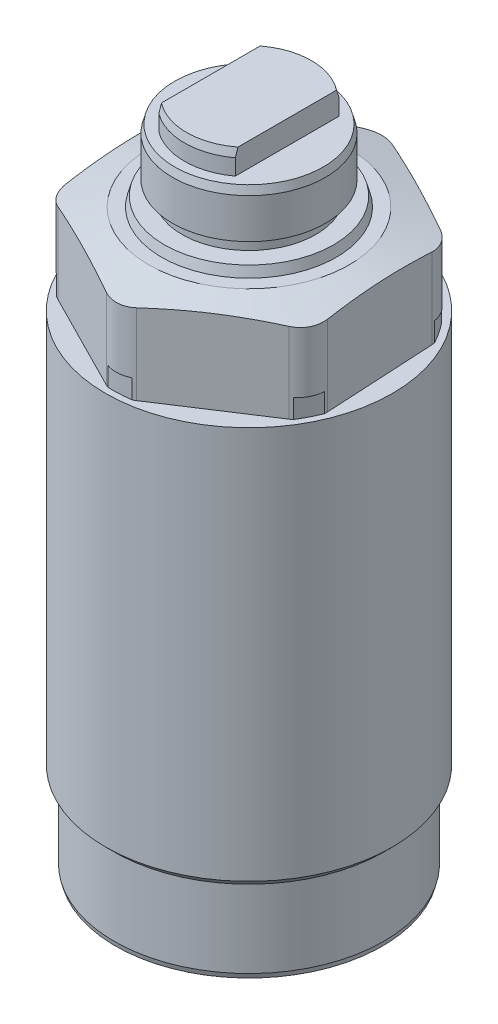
ISO-10303-21;
HEADER;
FILE_DESCRIPTION(('STEP AP214'),'2;1');
FILE_NAME('part.step','',(''),(''),'','','');
FILE_SCHEMA(('AUTOMOTIVE_DESIGN { 1 0 10303 214 1 1 1 1 }'));
ENDSEC;
DATA;
#1=APPLICATION_CONTEXT('core data for automotive mechanical design processes');
#2=APPLICATION_PROTOCOL_DEFINITION('international standard','automotive_design',2000,#1);
#3=PRODUCT_CONTEXT('',#1,'mechanical');
#4=PRODUCT('Part','Part','',(#3));
#5=PRODUCT_RELATED_PRODUCT_CATEGORY('part','',(#4));
#6=PRODUCT_DEFINITION_FORMATION('','',#4);
#7=PRODUCT_DEFINITION_CONTEXT('part definition',#1,'design');
#8=PRODUCT_DEFINITION('design','',#6,#7);
#9=PRODUCT_DEFINITION_SHAPE('','',#8);
#10=(LENGTH_UNIT() NAMED_UNIT(*) SI_UNIT(.MILLI.,.METRE.));
#11=(NAMED_UNIT(*) PLANE_ANGLE_UNIT() SI_UNIT($,.RADIAN.));
#12=(NAMED_UNIT(*) SI_UNIT($,.STERADIAN.) SOLID_ANGLE_UNIT());
#13=UNCERTAINTY_MEASURE_WITH_UNIT(LENGTH_MEASURE(1.E-05),#10,'distance_accuracy_value','');
#14=(GEOMETRIC_REPRESENTATION_CONTEXT(3) GLOBAL_UNCERTAINTY_ASSIGNED_CONTEXT((#13)) GLOBAL_UNIT_ASSIGNED_CONTEXT((#10,
#11,#12)) REPRESENTATION_CONTEXT('',''));
#15=CARTESIAN_POINT('',(0.,0.,0.));
#16=DIRECTION('',(0.,0.,1.));
#17=DIRECTION('',(1.,0.,0.));
#18=AXIS2_PLACEMENT_3D('',#15,#16,#17);
#19=CARTESIAN_POINT('',(0.,73.3901037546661,0.));
#20=DIRECTION('',(0.,1.,0.));
#21=DIRECTION('',(-1.,0.,0.));
#22=AXIS2_PLACEMENT_3D('',#19,#20,#21);
#23=CYLINDRICAL_SURFACE('',#22,6.75000034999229);
#24=DIRECTION('',(0.,1.,0.));
#25=VECTOR('',#24,1.);
#26=CARTESIAN_POINT('',(-3.99984246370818,73.3901037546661,5.43725712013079));
#27=LINE('',#26,#25);
#28=CARTESIAN_POINT('',(-3.99984246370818,65.5066654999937,5.43725712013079));
#29=VERTEX_POINT('',#28);
#30=CARTESIAN_POINT('',(-3.99984246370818,67.1699992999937,5.43725712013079));
#31=VERTEX_POINT('',#30);
#32=EDGE_CURVE('E386',#29,#31,#27,.T.);
#33=ORIENTED_EDGE('',*,*,#32,.F.);
#34=CARTESIAN_POINT('',(0.,65.5066654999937,0.));
#35=DIRECTION('',(0.,1.,0.));
#36=DIRECTION('',(-1.,0.,0.));
#37=AXIS2_PLACEMENT_3D('',#34,#35,#36);
#38=CIRCLE('',#37,6.75000034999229);
#39=CARTESIAN_POINT('',(3.99999999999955,65.5066654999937,5.4371412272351));
#40=VERTEX_POINT('',#39);
#41=EDGE_CURVE('E250',#29,#40,#38,.T.);
#42=ORIENTED_EDGE('',*,*,#41,.T.);
#43=DIRECTION('',(0.,1.,0.));
#44=VECTOR('',#43,1.);
#45=CARTESIAN_POINT('',(3.99999999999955,73.3901037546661,5.4371412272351));
#46=LINE('',#45,#44);
#47=CARTESIAN_POINT('',(3.99999999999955,67.1699992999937,5.4371412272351));
#48=VERTEX_POINT('',#47);
#49=EDGE_CURVE('E399',#48,#40,#46,.F.);
#50=ORIENTED_EDGE('',*,*,#49,.F.);
#51=CARTESIAN_POINT('',(0.,67.1699992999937,0.));
#52=DIRECTION('',(0.,1.,0.));
#53=DIRECTION('',(-1.,0.,0.));
#54=AXIS2_PLACEMENT_3D('',#51,#52,#53);
#55=CIRCLE('',#54,6.75000034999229);
#56=EDGE_CURVE('E429',#31,#48,#55,.T.);
#57=ORIENTED_EDGE('',*,*,#56,.F.);
#58=EDGE_LOOP('',(#33,#42,#50,#57));
#59=FACE_BOUND('',#58,.T.);
#60=ADVANCED_FACE('F34',(#59),#23,.T.);
#61=DIRECTION('',(0.,1.,0.));
#62=VECTOR('',#61,1.);
#63=CARTESIAN_POINT('',(-3.99932475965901,73.3901037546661,-5.43763792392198));
#64=LINE('',#63,#62);
#65=CARTESIAN_POINT('',(-3.99932475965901,67.1699992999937,-5.43763792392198));
#66=VERTEX_POINT('',#65);
#67=CARTESIAN_POINT('',(-3.99932475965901,65.5066654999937,-5.43763792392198));
#68=VERTEX_POINT('',#67);
#69=EDGE_CURVE('E231',#66,#68,#64,.F.);
#70=ORIENTED_EDGE('',*,*,#69,.F.);
#71=CARTESIAN_POINT('',(3.99999999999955,67.1699992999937,-5.4371412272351));
#72=VERTEX_POINT('',#71);
#73=EDGE_CURVE('E261',#72,#66,#55,.T.);
#74=ORIENTED_EDGE('',*,*,#73,.F.);
#75=DIRECTION('',(0.,1.,0.));
#76=VECTOR('',#75,1.);
#77=CARTESIAN_POINT('',(3.99999999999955,73.3901037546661,-5.4371412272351));
#78=LINE('',#77,#76);
#79=CARTESIAN_POINT('',(3.99999999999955,65.5066654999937,-5.4371412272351));
#80=VERTEX_POINT('',#79);
#81=EDGE_CURVE('E255',#80,#72,#78,.T.);
#82=ORIENTED_EDGE('',*,*,#81,.F.);
#83=EDGE_CURVE('E249',#80,#68,#38,.T.);
#84=ORIENTED_EDGE('',*,*,#83,.T.);
#85=EDGE_LOOP('',(#70,#74,#82,#84));
#86=FACE_BOUND('',#85,.T.);
#87=ADVANCED_FACE('F254',(#86),#23,.T.);
#88=CARTESIAN_POINT('',(0.,68.0033326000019,0.));
#89=DIRECTION('',(0.,-1.,0.));
#90=DIRECTION('',(1.,0.,0.));
#91=AXIS2_PLACEMENT_3D('',#88,#89,#90);
#92=CONICAL_SURFACE('',#91,6.52670936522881,0.261799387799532);
#93=CARTESIAN_POINT('',(-3.99933808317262,68.0035326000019,-5.15776409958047));
#94=CARTESIAN_POINT('',(-3.99933584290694,67.8647121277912,-5.20482313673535));
#95=CARTESIAN_POINT('',(-3.99933361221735,67.7258241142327,-5.25168101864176));
#96=CARTESIAN_POINT('',(-3.99932916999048,67.4479130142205,-5.34499446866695));
#97=CARTESIAN_POINT('',(-3.99932695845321,67.3088899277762,-5.39145003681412));
#98=CARTESIAN_POINT('',(-3.99932475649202,67.1697992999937,-5.43770444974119));
#99=B_SPLINE_CURVE_WITH_KNOTS('',3,(#93,#94,#95,#96,#97,#98),.UNSPECIFIED.,.F.,.F.,(4,2,4),(0.,
0.43973841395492,0.879476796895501),.UNSPECIFIED.);
#100=CARTESIAN_POINT('',(-3.99933807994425,68.0033326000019,-5.15783191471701));
#101=VERTEX_POINT('',#100);
#102=EDGE_CURVE('E237',#101,#66,#99,.T.);
#103=ORIENTED_EDGE('',*,*,#102,.F.);
#104=CARTESIAN_POINT('',(0.,68.0033326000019,0.));
#105=DIRECTION('',(0.,1.,0.));
#106=DIRECTION('',(-1.,0.,0.));
#107=AXIS2_PLACEMENT_3D('',#104,#105,#106);
#108=CIRCLE('',#107,6.52670936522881);
#109=CARTESIAN_POINT('',(3.99999999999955,68.0033326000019,-5.1573185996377));
#110=VERTEX_POINT('',#109);
#111=EDGE_CURVE('E427',#110,#101,#108,.T.);
#112=ORIENTED_EDGE('',*,*,#111,.F.);
#113=CARTESIAN_POINT('',(3.99999999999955,57.6173269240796,-8.40649945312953));
#114=CARTESIAN_POINT('',(3.99999999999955,58.0376795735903,-8.28176204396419));
#115=CARTESIAN_POINT('',(3.99999999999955,58.4578947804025,-8.15656096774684));
#116=CARTESIAN_POINT('',(3.99999999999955,59.2980036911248,-7.90507841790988));
#117=CARTESIAN_POINT('',(3.99999999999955,59.7178973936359,-7.7787969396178));
#118=CARTESIAN_POINT('',(3.99999999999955,60.9770801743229,-7.3980859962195));
#119=CARTESIAN_POINT('',(3.99999999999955,61.8158115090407,-7.14180760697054));
#120=CARTESIAN_POINT('',(3.99999999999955,63.490494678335,-6.6228060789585));
#121=CARTESIAN_POINT('',(3.99999999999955,64.326448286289,-6.36008868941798));
#122=CARTESIAN_POINT('',(3.99999999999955,65.5780910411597,-5.95887663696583));
#123=CARTESIAN_POINT('',(3.99999999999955,65.9949235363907,-5.82395011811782));
#124=CARTESIAN_POINT('',(3.99999999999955,66.8276309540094,-5.55117560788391));
#125=CARTESIAN_POINT('',(3.99999999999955,67.2435058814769,-5.41332763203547));
#126=CARTESIAN_POINT('',(3.99999999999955,68.0957541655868,-5.12671240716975));
#127=CARTESIAN_POINT('',(3.99999999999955,68.5320623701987,-4.97775108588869));
#128=CARTESIAN_POINT('',(3.99999999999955,69.4028740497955,-4.67470197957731));
#129=CARTESIAN_POINT('',(3.99999999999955,69.8373776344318,-4.52061451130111));
#130=CARTESIAN_POINT('',(3.99999999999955,70.4873721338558,-4.28432725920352));
#131=CARTESIAN_POINT('',(3.99999999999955,70.7037934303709,-4.20468644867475));
#132=CARTESIAN_POINT('',(3.99999999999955,71.1358830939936,-4.04339552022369));
#133=CARTESIAN_POINT('',(3.99999999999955,71.3515514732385,-3.96174543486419));
#134=CARTESIAN_POINT('',(3.99999999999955,71.7820223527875,-3.79606318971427));
#135=CARTESIAN_POINT('',(3.99999999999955,71.9968246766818,-3.7120305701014));
#136=CARTESIAN_POINT('',(3.99999999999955,72.4252932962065,-3.54108664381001));
#137=CARTESIAN_POINT('',(3.99999999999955,72.638959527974,-3.45417517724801));
#138=CARTESIAN_POINT('',(3.99999999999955,72.851931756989,-3.36557302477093));
#139=B_SPLINE_CURVE_WITH_KNOTS('',3,(#113,#114,#115,#116,#117,#118,#119,#120,#121,#122,#123,
#124,#125,#126,#127,#128,#129,#130,#131,#132,#133,#134,#135,#136,#137,#138),.UNSPECIFIED.,.F.,
.F.,(4,2,2,2,2,2,2,2,2,2,2,2,4),(0.,1.31540921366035,2.63082411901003,5.26183981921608,
7.89058627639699,9.20495646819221,10.5193196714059,11.9024058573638,13.2854067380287,
13.9772278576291,14.6690377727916,15.3609821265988,16.0529649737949),.UNSPECIFIED.);
#140=EDGE_CURVE('E375',#72,#110,#139,.T.);
#141=ORIENTED_EDGE('',*,*,#140,.F.);
#142=ORIENTED_EDGE('',*,*,#73,.T.);
#143=EDGE_LOOP('',(#103,#112,#141,#142));
#144=FACE_BOUND('',#143,.T.);
#145=ADVANCED_FACE('F356',(#144),#92,.T.);
#146=CARTESIAN_POINT('',(-3.99984246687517,67.1697992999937,5.43732364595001));
#147=CARTESIAN_POINT('',(-3.99984026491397,67.3088899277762,5.39106923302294));
#148=CARTESIAN_POINT('',(-3.9998380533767,67.4479130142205,5.34461366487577));
#149=CARTESIAN_POINT('',(-3.99983361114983,67.7258241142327,5.25130021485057));
#150=CARTESIAN_POINT('',(-3.99983138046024,67.8647121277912,5.20444233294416));
#151=CARTESIAN_POINT('',(-3.99982914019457,68.0035326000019,5.15738329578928));
#152=B_SPLINE_CURVE_WITH_KNOTS('',3,(#146,#147,#148,#149,#150,#151),.UNSPECIFIED.,.F.,.F.,(4,2,
4),(0.,0.439738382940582,0.879476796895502),.UNSPECIFIED.);
#153=CARTESIAN_POINT('',(-3.99982914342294,68.0033326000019,5.15745111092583));
#154=VERTEX_POINT('',#153);
#155=EDGE_CURVE('E251',#31,#154,#152,.T.);
#156=ORIENTED_EDGE('',*,*,#155,.F.);
#157=ORIENTED_EDGE('',*,*,#56,.T.);
#158=CARTESIAN_POINT('',(3.99999999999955,72.851931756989,3.36557302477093));
#159=CARTESIAN_POINT('',(3.99999999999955,72.638959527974,3.45417517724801));
#160=CARTESIAN_POINT('',(3.99999999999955,72.4252932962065,3.54108664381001));
#161=CARTESIAN_POINT('',(3.99999999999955,71.9968246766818,3.7120305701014));
#162=CARTESIAN_POINT('',(3.99999999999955,71.7820223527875,3.79606318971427));
#163=CARTESIAN_POINT('',(3.99999999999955,71.3515514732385,3.96174543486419));
#164=CARTESIAN_POINT('',(3.99999999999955,71.1358830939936,4.04339552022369));
#165=CARTESIAN_POINT('',(3.99999999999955,70.7037934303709,4.20468644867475));
#166=CARTESIAN_POINT('',(3.99999999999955,70.4873721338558,4.28432725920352));
#167=CARTESIAN_POINT('',(3.99999999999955,69.8373776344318,4.52061451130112));
#168=CARTESIAN_POINT('',(3.99999999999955,69.4028740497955,4.67470197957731));
#169=CARTESIAN_POINT('',(3.99999999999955,68.5320623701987,4.97775108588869));
#170=CARTESIAN_POINT('',(3.99999999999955,68.0957541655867,5.12671240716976));
#171=CARTESIAN_POINT('',(3.99999999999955,67.2435058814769,5.41332763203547));
#172=CARTESIAN_POINT('',(3.99999999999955,66.8276309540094,5.55117560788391));
#173=CARTESIAN_POINT('',(3.99999999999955,65.9949235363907,5.82395011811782));
#174=CARTESIAN_POINT('',(3.99999999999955,65.5780910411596,5.95887663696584));
#175=CARTESIAN_POINT('',(3.99999999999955,64.3264482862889,6.36008868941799));
#176=CARTESIAN_POINT('',(3.99999999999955,63.490494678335,6.6228060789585));
#177=CARTESIAN_POINT('',(3.99999999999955,61.8158115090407,7.14180760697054));
#178=CARTESIAN_POINT('',(3.99999999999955,60.9770801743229,7.3980859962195));
#179=CARTESIAN_POINT('',(3.99999999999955,59.7178973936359,7.7787969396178));
#180=CARTESIAN_POINT('',(3.99999999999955,59.2980036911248,7.90507841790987));
#181=CARTESIAN_POINT('',(3.99999999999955,58.4578947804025,8.15656096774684));
#182=CARTESIAN_POINT('',(3.99999999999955,58.0376795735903,8.28176204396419));
#183=CARTESIAN_POINT('',(3.99999999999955,57.6173269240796,8.40649945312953));
#184=B_SPLINE_CURVE_WITH_KNOTS('',3,(#158,#159,#160,#161,#162,#163,#164,#165,#166,#167,#168,
#169,#170,#171,#172,#173,#174,#175,#176,#177,#178,#179,#180,#181,#182,#183),.UNSPECIFIED.,.F.,
.F.,(4,2,2,2,2,2,2,2,2,2,2,2,4),(0.,0.691982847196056,1.38392720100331,2.0757371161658,
2.76755823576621,4.15055911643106,5.53364530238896,6.84800850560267,8.16237869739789,
10.7911251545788,13.4221408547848,14.7375557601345,16.0529649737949),.UNSPECIFIED.);
#185=CARTESIAN_POINT('',(3.99999999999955,68.0033326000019,5.1573185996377));
#186=VERTEX_POINT('',#185);
#187=EDGE_CURVE('E365',#186,#48,#184,.T.);
#188=ORIENTED_EDGE('',*,*,#187,.F.);
#189=EDGE_CURVE('E426',#154,#186,#108,.T.);
#190=ORIENTED_EDGE('',*,*,#189,.F.);
#191=EDGE_LOOP('',(#156,#157,#188,#190));
#192=FACE_BOUND('',#191,.T.);
#193=ADVANCED_FACE('F354',(#192),#92,.T.);
#194=CARTESIAN_POINT('',(-6.52670936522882,68.0033326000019,0.));
#195=DIRECTION('',(0.,1.,0.));
#196=DIRECTION('',(-1.,0.,0.));
#197=AXIS2_PLACEMENT_3D('',#194,#195,#196);
#198=PLANE('',#197);
#199=DIRECTION('',(4.7605429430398E-05,0.,-0.999999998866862));
#200=VECTOR('',#199,1.);
#201=CARTESIAN_POINT('',(-3.99958362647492,68.0033326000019,0.000120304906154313));
#202=LINE('',#201,#200);
#203=EDGE_CURVE('E434',#154,#101,#202,.T.);
#204=ORIENTED_EDGE('',*,*,#203,.F.);
#205=ORIENTED_EDGE('',*,*,#189,.T.);
#206=DIRECTION('',(0.,0.,1.));
#207=VECTOR('',#206,1.);
#208=CARTESIAN_POINT('',(3.99999999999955,68.0033326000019,0.));
#209=LINE('',#208,#207);
#210=EDGE_CURVE('E433',#110,#186,#209,.T.);
#211=ORIENTED_EDGE('',*,*,#210,.F.);
#212=ORIENTED_EDGE('',*,*,#111,.T.);
#213=EDGE_LOOP('',(#204,#205,#211,#212));
#214=FACE_BOUND('',#213,.T.);
#215=ADVANCED_FACE('F351',(#214),#198,.T.);
#216=CARTESIAN_POINT('',(0.,58.0033326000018,0.));
#217=DIRECTION('',(0.,-1.,0.));
#218=DIRECTION('',(1.,0.,0.));
#219=AXIS2_PLACEMENT_3D('',#216,#217,#218);
#220=CONICAL_SURFACE('',#219,10.500000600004,1.30899693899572);
#221=CARTESIAN_POINT('',(0.,58.0033326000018,0.));
#222=DIRECTION('',(0.,1.,0.));
#223=DIRECTION('',(-1.,0.,0.));
#224=AXIS2_PLACEMENT_3D('',#221,#222,#223);
#225=CIRCLE('',#224,10.500000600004);
#226=CARTESIAN_POINT('',(-10.500000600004,58.0033326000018,0.));
#227=VERTEX_POINT('',#226);
#228=EDGE_CURVE('E282',#227,#227,#225,.T.);
#229=ORIENTED_EDGE('',*,*,#228,.F.);
#230=EDGE_LOOP('',(#229));
#231=FACE_BOUND('',#230,.T.);
#232=CARTESIAN_POINT('',(-0.809428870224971,56.797529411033,-14.9782644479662));
#233=CARTESIAN_POINT('',(-1.33130605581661,56.8810200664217,-14.6381341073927));
#234=CARTESIAN_POINT('',(-1.85412943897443,56.9568156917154,-14.2973870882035));
#235=CARTESIAN_POINT('',(-2.9016225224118,57.0899813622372,-13.6146897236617));
#236=CARTESIAN_POINT('',(-3.42629288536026,57.1473439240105,-13.2727389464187));
#237=CARTESIAN_POINT('',(-4.47429898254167,57.2402948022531,-12.5897072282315));
#238=CARTESIAN_POINT('',(-4.9976276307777,57.2759939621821,-12.2486309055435));
#239=CARTESIAN_POINT('',(-6.04495227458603,57.3238628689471,-11.5660433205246));
#240=CARTESIAN_POINT('',(-6.568948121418,57.3360371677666,-11.2245321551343));
#241=CARTESIAN_POINT('',(-7.61693981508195,57.3360371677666,-10.5415098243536));
#242=CARTESIAN_POINT('',(-8.14093566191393,57.3238628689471,-10.1999986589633));
#243=CARTESIAN_POINT('',(-9.18826030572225,57.2759939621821,-9.51741107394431));
#244=CARTESIAN_POINT('',(-9.71158895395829,57.2402948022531,-9.17633475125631));
#245=CARTESIAN_POINT('',(-10.7595950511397,57.1473439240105,-8.49330303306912));
#246=CARTESIAN_POINT('',(-11.2842654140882,57.0899813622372,-8.15135225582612));
#247=CARTESIAN_POINT('',(-12.3317584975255,56.9568156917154,-7.46865489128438));
#248=CARTESIAN_POINT('',(-12.8545818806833,56.8810200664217,-7.12790787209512));
#249=CARTESIAN_POINT('',(-13.376459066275,56.797529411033,-6.78777753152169));
#250=B_SPLINE_CURVE_WITH_KNOTS('',3,(#232,#233,#234,#235,#236,#237,#238,#239,#240,#241,#242,
#243,#244,#245,#246,#247,#248,#249),.UNSPECIFIED.,.F.,.F.,(4,2,2,2,2,2,2,2,4),(0.,
1.88560566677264,3.77197588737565,5.64861104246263,7.52488303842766,9.40115503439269,
11.2777901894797,13.1641604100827,15.0497660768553),.UNSPECIFIED.);
#251=CARTESIAN_POINT('',(-2.26069833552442,57.0083443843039,-14.0324082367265));
#252=VERTEX_POINT('',#251);
#253=CARTESIAN_POINT('',(-11.9251896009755,57.0083443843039,-7.73363374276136));
#254=VERTEX_POINT('',#253);
#255=EDGE_CURVE('E437',#252,#254,#250,.T.);
#256=ORIENTED_EDGE('',*,*,#255,.T.);
#257=CARTESIAN_POINT('',(-11.9251896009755,57.0083443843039,-7.73363374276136));
#258=CARTESIAN_POINT('',(-11.9942867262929,56.9993757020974,-7.68861038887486));
#259=CARTESIAN_POINT('',(-12.0615771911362,56.9910734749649,-7.64068466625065));
#260=CARTESIAN_POINT('',(-12.1920764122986,56.975835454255,-7.53936889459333));
#261=CARTESIAN_POINT('',(-12.2552851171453,56.9688996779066,-7.4859787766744));
#262=CARTESIAN_POINT('',(-12.3770955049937,56.9564339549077,-7.37412642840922));
#263=CARTESIAN_POINT('',(-12.4357013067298,56.9509027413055,-7.31566883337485));
#264=CARTESIAN_POINT('',(-12.5479228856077,56.9412639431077,-7.19406940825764));
#265=CARTESIAN_POINT('',(-12.6015388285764,56.9371563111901,-7.13092773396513));
#266=CARTESIAN_POINT('',(-12.7543619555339,56.9269976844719,-6.93501301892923));
#267=CARTESIAN_POINT('',(-12.8455712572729,56.9231082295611,-6.79572563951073));
#268=CARTESIAN_POINT('',(-13.0037094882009,56.9211940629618,-6.50399086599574));
#269=CARTESIAN_POINT('',(-13.0706320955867,56.9231708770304,-6.35154005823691));
#270=CARTESIAN_POINT('',(-13.1781298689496,56.9329227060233,-6.03852495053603));
#271=CARTESIAN_POINT('',(-13.2188138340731,56.9406734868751,-5.87799716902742));
#272=CARTESIAN_POINT('',(-13.2731762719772,56.9618004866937,-5.55297700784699));
#273=CARTESIAN_POINT('',(-13.2869052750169,56.9751661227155,-5.38849263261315));
#274=CARTESIAN_POINT('',(-13.2871813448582,56.9938953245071,-5.19678103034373));
#275=CARTESIAN_POINT('',(-13.2868351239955,56.996681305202,-5.16905584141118));
#276=CARTESIAN_POINT('',(-13.2853759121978,57.0024013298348,-5.11367406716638));
#277=CARTESIAN_POINT('',(-13.2842638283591,57.0053351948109,-5.08601743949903));
#278=CARTESIAN_POINT('',(-13.2827711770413,57.0083443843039,-5.0583819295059));
#279=B_SPLINE_CURVE_WITH_KNOTS('',3,(#257,#258,#259,#260,#261,#262,#263,#264,#265,#266,#267,
#268,#269,#270,#271,#272,#273,#274,#275,#276,#277,#278),.UNSPECIFIED.,.F.,.F.,(4,2,2,2,2,2,2,2,
2,2,4),(0.,0.248796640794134,0.497596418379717,0.746170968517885,0.994737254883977,
1.4917616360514,1.98891529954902,2.48399401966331,2.97814376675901,3.06174137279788,
3.14524013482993),.UNSPECIFIED.);
#280=CARTESIAN_POINT('',(-13.2827711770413,57.0083443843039,-5.0583819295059));
#281=VERTEX_POINT('',#280);
#282=EDGE_CURVE('E492',#254,#281,#279,.T.);
#283=ORIENTED_EDGE('',*,*,#282,.T.);
#284=CARTESIAN_POINT('',(-13.3762698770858,56.7975345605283,-6.78810788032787));
#285=CARTESIAN_POINT('',(-13.342647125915,56.8810244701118,-6.16608698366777));
#286=CARTESIAN_POINT('',(-13.308963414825,56.9568193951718,-5.5429383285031));
#287=CARTESIAN_POINT('',(-13.2414770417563,57.0899838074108,-4.29444042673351));
#288=CARTESIAN_POINT('',(-13.2076743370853,57.1473458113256,-3.66909039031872));
#289=CARTESIAN_POINT('',(-13.1401549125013,57.2402957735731,-2.41998103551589));
#290=CARTESIAN_POINT('',(-13.1064386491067,57.2759945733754,-1.79623016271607));
#291=CARTESIAN_POINT('',(-13.0389631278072,57.3238629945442,-0.547933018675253));
#292=CARTESIAN_POINT('',(-13.0052038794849,57.3360371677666,0.0766130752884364));
#293=CARTESIAN_POINT('',(-12.9376853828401,57.3360371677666,1.32570526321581));
#294=CARTESIAN_POINT('',(-12.9039261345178,57.3238629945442,1.9502513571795));
#295=CARTESIAN_POINT('',(-12.8364506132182,57.2759945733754,3.19854850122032));
#296=CARTESIAN_POINT('',(-12.8027343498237,57.2402957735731,3.82229937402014));
#297=CARTESIAN_POINT('',(-12.7352149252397,57.1473458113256,5.07140872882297));
#298=CARTESIAN_POINT('',(-12.7014122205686,57.0899838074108,5.69675876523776));
#299=CARTESIAN_POINT('',(-12.6339258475,56.9568193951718,6.94525666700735));
#300=CARTESIAN_POINT('',(-12.60024213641,56.8810244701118,7.56840532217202));
#301=CARTESIAN_POINT('',(-12.5666193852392,56.7975345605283,8.19042621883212));
#302=B_SPLINE_CURVE_WITH_KNOTS('',3,(#284,#285,#286,#287,#288,#289,#290,#291,#292,#293,#294,
#295,#296,#297,#298,#299,#300,#301),.UNSPECIFIED.,.F.,.F.,(4,2,2,2,2,2,2,2,4),(0.,
1.88559591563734,3.77195636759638,5.64858189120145,7.52484426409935,9.40110663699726,
11.2777321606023,13.1640926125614,15.0496885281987),.UNSPECIFIED.);
#303=CARTESIAN_POINT('',(-12.6601180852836,57.0083443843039,6.46070026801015));
#304=VERTEX_POINT('',#303);
#305=EDGE_CURVE('E936',#281,#304,#302,.T.);
#306=ORIENTED_EDGE('',*,*,#305,.T.);
#307=CARTESIAN_POINT('',(-12.6601180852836,57.008344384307,6.46070026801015));
#308=CARTESIAN_POINT('',(-12.655675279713,56.9993757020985,6.54305181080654));
#309=CARTESIAN_POINT('',(-12.6478156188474,56.9910734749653,6.62528992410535));
#310=CARTESIAN_POINT('',(-12.6253231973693,56.9758354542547,6.7889634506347));
#311=CARTESIAN_POINT('',(-12.6106903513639,56.9688996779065,6.87039885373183));
#312=CARTESIAN_POINT('',(-12.5747285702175,56.9564339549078,7.03181591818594));
#313=CARTESIAN_POINT('',(-12.5534057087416,56.9509027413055,7.11179882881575));
#314=CARTESIAN_POINT('',(-12.5042083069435,56.9412639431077,7.26978527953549));
#315=CARTESIAN_POINT('',(-12.476333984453,56.9371563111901,7.34778888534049));
#316=CARTESIAN_POINT('',(-12.3830784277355,56.9269976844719,7.57809495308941));
#317=CARTESIAN_POINT('',(-12.308056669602,56.9231082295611,7.72672821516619));
#318=CARTESIAN_POINT('',(-12.1344760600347,56.9211940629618,8.00954732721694));
#319=CARTESIAN_POINT('',(-12.0359110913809,56.9231708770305,8.14372940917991));
#320=CARTESIAN_POINT('',(-11.8185809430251,56.9329227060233,8.39333276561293));
#321=CARTESIAN_POINT('',(-11.6999017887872,56.9406734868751,8.50883000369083));
#322=CARTESIAN_POINT('',(-11.4456072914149,56.9618004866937,8.7184193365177));
#323=CARTESIAN_POINT('',(-11.3100241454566,56.9751661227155,8.81255118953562));
#324=CARTESIAN_POINT('',(-11.1441350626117,56.9938953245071,8.90864607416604));
#325=CARTESIAN_POINT('',(-11.1199512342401,56.996681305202,8.92220883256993));
#326=CARTESIAN_POINT('',(-11.0712596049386,57.0024013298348,8.94863600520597));
#327=CARTESIAN_POINT('',(-11.0467522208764,57.0053351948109,8.96150122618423));
#328=CARTESIAN_POINT('',(-11.0220728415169,57.0083443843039,8.97402630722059));
#329=B_SPLINE_CURVE_WITH_KNOTS('',3,(#307,#308,#309,#310,#311,#312,#313,#314,#315,#316,#317,
#318,#319,#320,#321,#322,#323,#324,#325,#326,#327,#328),.UNSPECIFIED.,.F.,.F.,(4,2,2,2,2,2,2,2,
2,2,4),(0.,0.248796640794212,0.497596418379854,0.74617096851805,0.994737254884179,
1.49176163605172,1.98891529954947,2.48399401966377,2.97814376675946,3.06174137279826,
3.14524013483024),.UNSPECIFIED.);
#330=CARTESIAN_POINT('',(-11.0220728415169,57.008344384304,8.97402630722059));
#331=VERTEX_POINT('',#330);
#332=EDGE_CURVE('E487',#304,#331,#329,.T.);
#333=ORIENTED_EDGE('',*,*,#332,.T.);
#334=CARTESIAN_POINT('',(-12.56683019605,56.7975313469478,8.19012472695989));
#335=CARTESIAN_POINT('',(-12.0113311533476,56.8810217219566,8.47201791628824));
#336=CARTESIAN_POINT('',(-11.454824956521,56.9568170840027,8.754422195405));
#337=CARTESIAN_POINT('',(-10.3398473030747,57.0899822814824,9.32022804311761));
#338=CARTESIAN_POINT('',(-9.78137514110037,57.1473446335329,9.6036299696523));
#339=CARTESIAN_POINT('',(-8.66585142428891,57.2402951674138,10.1697129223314));
#340=CARTESIAN_POINT('',(-8.10880741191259,57.2759941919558,10.4523901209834));
#341=CARTESIAN_POINT('',(-6.99400904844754,57.3238629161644,11.0181049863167));
#342=CARTESIAN_POINT('',(-6.43625485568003,57.3360371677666,11.3011425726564));
#343=CARTESIAN_POINT('',(-5.32074647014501,57.3360371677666,11.8672177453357));
#344=CARTESIAN_POINT('',(-4.76299227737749,57.3238629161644,12.1502553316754));
#345=CARTESIAN_POINT('',(-3.64819391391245,57.2759941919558,12.7159701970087));
#346=CARTESIAN_POINT('',(-3.09114990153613,57.2402951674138,12.9986473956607));
#347=CARTESIAN_POINT('',(-1.97562618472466,57.1473446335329,13.5647303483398));
#348=CARTESIAN_POINT('',(-1.41715402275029,57.0899822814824,13.8481322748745));
#349=CARTESIAN_POINT('',(-0.302176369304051,56.9568170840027,14.4139381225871));
#350=CARTESIAN_POINT('',(0.254329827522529,56.8810217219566,14.6963424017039));
#351=CARTESIAN_POINT('',(0.809828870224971,56.7975313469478,14.9782355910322));
#352=B_SPLINE_CURVE_WITH_KNOTS('',3,(#334,#335,#336,#337,#338,#339,#340,#341,#342,#343,#344,
#345,#346,#347,#348,#349,#350,#351),.UNSPECIFIED.,.F.,.F.,(4,2,2,2,2,2,2,2,4),(0.,
1.88560200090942,3.77196854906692,5.64860008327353,7.52486846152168,9.40113683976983,
11.2777683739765,13.164134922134,15.0497369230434),.UNSPECIFIED.);
#353=CARTESIAN_POINT('',(-0.7349284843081,57.0083443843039,14.1943340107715));
#354=VERTEX_POINT('',#353);
#355=EDGE_CURVE('E942',#331,#354,#352,.T.);
#356=ORIENTED_EDGE('',*,*,#355,.T.);
#357=CARTESIAN_POINT('',(-0.7349284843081,57.0083443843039,14.1943340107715));
#358=CARTESIAN_POINT('',(-0.661388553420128,56.9993757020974,14.2316621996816));
#359=CARTESIAN_POINT('',(-0.586238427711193,56.9910734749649,14.2659745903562));
#360=CARTESIAN_POINT('',(-0.433246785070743,56.975835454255,14.3283323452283));
#361=CARTESIAN_POINT('',(-0.35540523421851,56.9688996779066,14.3563776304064));
#362=CARTESIAN_POINT('',(-0.197633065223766,56.9564339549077,14.4059423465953));
#363=CARTESIAN_POINT('',(-0.117704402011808,56.9509027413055,14.4274676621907));
#364=CARTESIAN_POINT('',(0.0437145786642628,56.9412639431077,14.4638546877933));
#365=CARTESIAN_POINT('',(0.125204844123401,56.9371563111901,14.4787166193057));
#366=CARTESIAN_POINT('',(0.371283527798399,56.9269976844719,14.5131079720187));
#367=CARTESIAN_POINT('',(0.537514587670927,56.9231082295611,14.5224538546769));
#368=CARTESIAN_POINT('',(0.869233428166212,56.9211940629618,14.5135381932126));
#369=CARTESIAN_POINT('',(1.03472100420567,56.9231708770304,14.4952694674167));
#370=CARTESIAN_POINT('',(1.35954892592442,56.9329227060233,14.4318577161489));
#371=CARTESIAN_POINT('',(1.51891204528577,56.9406734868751,14.3868271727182));
#372=CARTESIAN_POINT('',(1.82756898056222,56.9618004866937,14.2713963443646));
#373=CARTESIAN_POINT('',(1.97688112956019,56.9751661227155,14.2010438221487));
#374=CARTESIAN_POINT('',(2.14304628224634,56.9938953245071,14.1054271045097));
#375=CARTESIAN_POINT('',(2.16688388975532,56.996681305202,14.0912646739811));
#376=CARTESIAN_POINT('',(2.21411630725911,57.0024013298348,14.0623100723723));
#377=CARTESIAN_POINT('',(2.23751160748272,57.0053351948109,14.0475186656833));
#378=CARTESIAN_POINT('',(2.26069833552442,57.0083443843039,14.0324082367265));
#379=B_SPLINE_CURVE_WITH_KNOTS('',3,(#357,#358,#359,#360,#361,#362,#363,#364,#365,#366,#367,
#368,#369,#370,#371,#372,#373,#374,#375,#376,#377,#378),.UNSPECIFIED.,.F.,.F.,(4,2,2,2,2,2,2,2,
2,2,4),(0.,0.248796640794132,0.497596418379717,0.746170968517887,0.994737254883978,
1.49176163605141,1.98891529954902,2.48399401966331,2.97814376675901,3.06174137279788,
3.14524013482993),.UNSPECIFIED.);
#380=CARTESIAN_POINT('',(2.26069833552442,57.0083443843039,14.0324082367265));
#381=VERTEX_POINT('',#380);
#382=EDGE_CURVE('E482',#354,#381,#379,.T.);
#383=ORIENTED_EDGE('',*,*,#382,.T.);
#384=CARTESIAN_POINT('',(0.809428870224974,56.797529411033,14.9782644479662));
#385=CARTESIAN_POINT('',(1.33130605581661,56.8810200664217,14.6381341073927));
#386=CARTESIAN_POINT('',(1.85412943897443,56.9568156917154,14.2973870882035));
#387=CARTESIAN_POINT('',(2.90162252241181,57.0899813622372,13.6146897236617));
#388=CARTESIAN_POINT('',(3.42629288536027,57.1473439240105,13.2727389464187));
#389=CARTESIAN_POINT('',(4.47429898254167,57.2402948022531,12.5897072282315));
#390=CARTESIAN_POINT('',(4.99762763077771,57.2759939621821,12.2486309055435));
#391=CARTESIAN_POINT('',(6.04495227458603,57.3238628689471,11.5660433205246));
#392=CARTESIAN_POINT('',(6.56894812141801,57.3360371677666,11.2245321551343));
#393=CARTESIAN_POINT('',(7.61693981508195,57.3360371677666,10.5415098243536));
#394=CARTESIAN_POINT('',(8.14093566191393,57.3238628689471,10.1999986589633));
#395=CARTESIAN_POINT('',(9.18826030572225,57.2759939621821,9.51741107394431));
#396=CARTESIAN_POINT('',(9.71158895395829,57.2402948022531,9.17633475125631));
#397=CARTESIAN_POINT('',(10.7595950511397,57.1473439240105,8.49330303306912));
#398=CARTESIAN_POINT('',(11.2842654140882,57.0899813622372,8.15135225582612));
#399=CARTESIAN_POINT('',(12.3317584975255,56.9568156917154,7.46865489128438));
#400=CARTESIAN_POINT('',(12.8545818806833,56.8810200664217,7.12790787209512));
#401=CARTESIAN_POINT('',(13.376459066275,56.797529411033,6.78777753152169));
#402=B_SPLINE_CURVE_WITH_KNOTS('',3,(#384,#385,#386,#387,#388,#389,#390,#391,#392,#393,#394,
#395,#396,#397,#398,#399,#400,#401),.UNSPECIFIED.,.F.,.F.,(4,2,2,2,2,2,2,2,4),(0.,
1.88560566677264,3.77197588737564,5.64861104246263,7.52488303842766,9.40115503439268,
11.2777901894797,13.1641604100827,15.0497660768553),.UNSPECIFIED.);
#403=CARTESIAN_POINT('',(11.9251896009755,57.0083443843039,7.73363374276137));
#404=VERTEX_POINT('',#403);
#405=EDGE_CURVE('E944',#381,#404,#402,.T.);
#406=ORIENTED_EDGE('',*,*,#405,.T.);
#407=CARTESIAN_POINT('',(11.9251896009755,57.0083443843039,7.73363374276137));
#408=CARTESIAN_POINT('',(11.9942867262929,56.9993757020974,7.68861038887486));
#409=CARTESIAN_POINT('',(12.0615771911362,56.9910734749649,7.64068466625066));
#410=CARTESIAN_POINT('',(12.1920764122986,56.975835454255,7.53936889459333));
#411=CARTESIAN_POINT('',(12.2552851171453,56.9688996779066,7.4859787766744));
#412=CARTESIAN_POINT('',(12.3770955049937,56.9564339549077,7.37412642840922));
#413=CARTESIAN_POINT('',(12.4357013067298,56.9509027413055,7.31566883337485));
#414=CARTESIAN_POINT('',(12.5479228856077,56.9412639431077,7.19406940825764));
#415=CARTESIAN_POINT('',(12.6015388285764,56.9371563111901,7.13092773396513));
#416=CARTESIAN_POINT('',(12.7543619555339,56.9269976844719,6.93501301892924));
#417=CARTESIAN_POINT('',(12.8455712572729,56.9231082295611,6.79572563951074));
#418=CARTESIAN_POINT('',(13.0037094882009,56.9211940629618,6.50399086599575));
#419=CARTESIAN_POINT('',(13.0706320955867,56.9231708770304,6.35154005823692));
#420=CARTESIAN_POINT('',(13.1781298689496,56.9329227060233,6.03852495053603));
#421=CARTESIAN_POINT('',(13.2188138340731,56.9406734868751,5.87799716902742));
#422=CARTESIAN_POINT('',(13.2731762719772,56.9618004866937,5.55297700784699));
#423=CARTESIAN_POINT('',(13.2869052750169,56.9751661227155,5.38849263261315));
#424=CARTESIAN_POINT('',(13.2871813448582,56.9938953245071,5.19678103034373));
#425=CARTESIAN_POINT('',(13.2868351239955,56.996681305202,5.16905584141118));
#426=CARTESIAN_POINT('',(13.2853759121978,57.0024013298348,5.11367406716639));
#427=CARTESIAN_POINT('',(13.2842638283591,57.0053351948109,5.08601743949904));
#428=CARTESIAN_POINT('',(13.2827711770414,57.0083443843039,5.0583819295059));
#429=B_SPLINE_CURVE_WITH_KNOTS('',3,(#407,#408,#409,#410,#411,#412,#413,#414,#415,#416,#417,
#418,#419,#420,#421,#422,#423,#424,#425,#426,#427,#428),.UNSPECIFIED.,.F.,.F.,(4,2,2,2,2,2,2,2,
2,2,4),(0.,0.248796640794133,0.497596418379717,0.746170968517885,0.994737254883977,
1.49176163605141,1.98891529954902,2.48399401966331,2.97814376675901,3.06174137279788,
3.14524013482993),.UNSPECIFIED.);
#430=CARTESIAN_POINT('',(13.2827711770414,57.0083443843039,5.0583819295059));
#431=VERTEX_POINT('',#430);
#432=EDGE_CURVE('E459',#404,#431,#429,.T.);
#433=ORIENTED_EDGE('',*,*,#432,.T.);
#434=CARTESIAN_POINT('',(13.3762698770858,56.7975345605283,6.78810788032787));
#435=CARTESIAN_POINT('',(13.342647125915,56.8810244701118,6.16608698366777));
#436=CARTESIAN_POINT('',(13.308963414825,56.9568193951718,5.5429383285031));
#437=CARTESIAN_POINT('',(13.2414770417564,57.0899838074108,4.29444042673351));
#438=CARTESIAN_POINT('',(13.2076743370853,57.1473458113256,3.66909039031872));
#439=CARTESIAN_POINT('',(13.1401549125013,57.2402957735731,2.41998103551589));
#440=CARTESIAN_POINT('',(13.1064386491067,57.2759945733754,1.79623016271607));
#441=CARTESIAN_POINT('',(13.0389631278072,57.3238629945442,0.547933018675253));
#442=CARTESIAN_POINT('',(13.0052038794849,57.3360371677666,-0.0766130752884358));
#443=CARTESIAN_POINT('',(12.9376853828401,57.3360371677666,-1.32570526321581));
#444=CARTESIAN_POINT('',(12.9039261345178,57.3238629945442,-1.9502513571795));
#445=CARTESIAN_POINT('',(12.8364506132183,57.2759945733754,-3.19854850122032));
#446=CARTESIAN_POINT('',(12.8027343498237,57.2402957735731,-3.82229937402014));
#447=CARTESIAN_POINT('',(12.7352149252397,57.1473458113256,-5.07140872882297));
#448=CARTESIAN_POINT('',(12.7014122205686,57.0899838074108,-5.69675876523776));
#449=CARTESIAN_POINT('',(12.6339258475,56.9568193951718,-6.94525666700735));
#450=CARTESIAN_POINT('',(12.60024213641,56.8810244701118,-7.56840532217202));
#451=CARTESIAN_POINT('',(12.5666193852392,56.7975345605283,-8.19042621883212));
#452=B_SPLINE_CURVE_WITH_KNOTS('',3,(#434,#435,#436,#437,#438,#439,#440,#441,#442,#443,#444,
#445,#446,#447,#448,#449,#450,#451),.UNSPECIFIED.,.F.,.F.,(4,2,2,2,2,2,2,2,4),(0.,
1.88559591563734,3.77195636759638,5.64858189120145,7.52484426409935,9.40110663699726,
11.2777321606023,13.1640926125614,15.0496885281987),.UNSPECIFIED.);
#453=CARTESIAN_POINT('',(12.6601180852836,57.0083443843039,-6.46070026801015));
#454=VERTEX_POINT('',#453);
#455=EDGE_CURVE('E326',#431,#454,#452,.T.);
#456=ORIENTED_EDGE('',*,*,#455,.T.);
#457=CARTESIAN_POINT('',(12.6601180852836,57.0083443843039,-6.46070026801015));
#458=CARTESIAN_POINT('',(12.655675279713,56.9993757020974,-6.54305181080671));
#459=CARTESIAN_POINT('',(12.6478156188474,56.9910734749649,-6.62528992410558));
#460=CARTESIAN_POINT('',(12.6253231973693,56.975835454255,-6.78896345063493));
#461=CARTESIAN_POINT('',(12.6106903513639,56.9688996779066,-6.87039885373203));
#462=CARTESIAN_POINT('',(12.5747285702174,56.9564339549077,-7.03181591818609));
#463=CARTESIAN_POINT('',(12.5534057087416,56.9509027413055,-7.11179882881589));
#464=CARTESIAN_POINT('',(12.5042083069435,56.9412639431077,-7.26978527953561));
#465=CARTESIAN_POINT('',(12.476333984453,56.9371563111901,-7.3477888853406));
#466=CARTESIAN_POINT('',(12.3830784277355,56.9269976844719,-7.57809495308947));
#467=CARTESIAN_POINT('',(12.308056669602,56.9231082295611,-7.72672821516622));
#468=CARTESIAN_POINT('',(12.1344760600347,56.9211940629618,-8.00954732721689));
#469=CARTESIAN_POINT('',(12.035911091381,56.9231708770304,-8.14372940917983));
#470=CARTESIAN_POINT('',(11.8185809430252,56.9329227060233,-8.39333276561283));
#471=CARTESIAN_POINT('',(11.6999017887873,56.9406734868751,-8.50883000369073));
#472=CARTESIAN_POINT('',(11.445607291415,56.9618004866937,-8.71841933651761));
#473=CARTESIAN_POINT('',(11.3100241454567,56.9751661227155,-8.81255118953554));
#474=CARTESIAN_POINT('',(11.1441350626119,56.9938953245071,-8.90864607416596));
#475=CARTESIAN_POINT('',(11.1199512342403,56.996681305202,-8.92220883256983));
#476=CARTESIAN_POINT('',(11.0712596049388,57.0024013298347,-8.94863600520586));
#477=CARTESIAN_POINT('',(11.0467522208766,57.0053351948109,-8.96150122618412));
#478=CARTESIAN_POINT('',(11.0220728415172,57.0083443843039,-8.97402630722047));
#479=B_SPLINE_CURVE_WITH_KNOTS('',3,(#457,#458,#459,#460,#461,#462,#463,#464,#465,#466,#467,
#468,#469,#470,#471,#472,#473,#474,#475,#476,#477,#478),.UNSPECIFIED.,.F.,.F.,(4,2,2,2,2,2,2,2,
2,2,4),(0.,0.248796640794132,0.497596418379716,0.746170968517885,0.994737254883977,
1.49176163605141,1.98891529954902,2.48399401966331,2.97814376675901,3.06174137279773,
3.14524013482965),.UNSPECIFIED.);
#480=CARTESIAN_POINT('',(11.0220728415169,57.0083443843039,-8.97402630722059));
#481=VERTEX_POINT('',#480);
#482=EDGE_CURVE('E454',#454,#481,#479,.T.);
#483=ORIENTED_EDGE('',*,*,#482,.T.);
#484=CARTESIAN_POINT('',(12.56683019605,56.7975313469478,-8.19012472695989));
#485=CARTESIAN_POINT('',(12.0113311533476,56.8810217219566,-8.47201791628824));
#486=CARTESIAN_POINT('',(11.454824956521,56.9568170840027,-8.754422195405));
#487=CARTESIAN_POINT('',(10.3398473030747,57.0899822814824,-9.32022804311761));
#488=CARTESIAN_POINT('',(9.78137514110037,57.1473446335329,-9.60362996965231));
#489=CARTESIAN_POINT('',(8.66585142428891,57.2402951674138,-10.1697129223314));
#490=CARTESIAN_POINT('',(8.10880741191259,57.2759941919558,-10.4523901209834));
#491=CARTESIAN_POINT('',(6.99400904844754,57.3238629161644,-11.0181049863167));
#492=CARTESIAN_POINT('',(6.43625485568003,57.3360371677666,-11.3011425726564));
#493=CARTESIAN_POINT('',(5.32074647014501,57.3360371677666,-11.8672177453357));
#494=CARTESIAN_POINT('',(4.76299227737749,57.3238629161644,-12.1502553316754));
#495=CARTESIAN_POINT('',(3.64819391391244,57.2759941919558,-12.7159701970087));
#496=CARTESIAN_POINT('',(3.09114990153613,57.2402951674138,-12.9986473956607));
#497=CARTESIAN_POINT('',(1.97562618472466,57.1473446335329,-13.5647303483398));
#498=CARTESIAN_POINT('',(1.41715402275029,57.0899822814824,-13.8481322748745));
#499=CARTESIAN_POINT('',(0.302176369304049,56.9568170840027,-14.4139381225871));
#500=CARTESIAN_POINT('',(-0.254329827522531,56.8810217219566,-14.6963424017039));
#501=CARTESIAN_POINT('',(-0.809828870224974,56.7975313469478,-14.9782355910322));
#502=B_SPLINE_CURVE_WITH_KNOTS('',3,(#484,#485,#486,#487,#488,#489,#490,#491,#492,#493,#494,
#495,#496,#497,#498,#499,#500,#501),.UNSPECIFIED.,.F.,.F.,(4,2,2,2,2,2,2,2,4),(0.,
1.88560200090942,3.77196854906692,5.64860008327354,7.52486846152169,9.40113683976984,
11.2777683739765,13.164134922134,15.0497369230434),.UNSPECIFIED.);
#503=CARTESIAN_POINT('',(0.734928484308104,57.0083443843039,-14.1943340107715));
#504=VERTEX_POINT('',#503);
#505=EDGE_CURVE('E318',#481,#504,#502,.T.);
#506=ORIENTED_EDGE('',*,*,#505,.T.);
#507=CARTESIAN_POINT('',(0.734928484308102,57.0083443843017,-14.1943340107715));
#508=CARTESIAN_POINT('',(0.661388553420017,56.9993757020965,-14.2316621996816));
#509=CARTESIAN_POINT('',(0.586238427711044,56.9910734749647,-14.2659745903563));
#510=CARTESIAN_POINT('',(0.433246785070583,56.9758354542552,-14.3283323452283));
#511=CARTESIAN_POINT('',(0.355405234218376,56.9688996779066,-14.3563776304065));
#512=CARTESIAN_POINT('',(0.19763306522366,56.9564339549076,-14.4059423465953));
#513=CARTESIAN_POINT('',(0.117704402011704,56.9509027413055,-14.4274676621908));
#514=CARTESIAN_POINT('',(-0.0437145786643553,56.9412639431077,-14.4638546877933));
#515=CARTESIAN_POINT('',(-0.125204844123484,56.9371563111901,-14.4787166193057));
#516=CARTESIAN_POINT('',(-0.371283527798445,56.9269976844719,-14.5131079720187));
#517=CARTESIAN_POINT('',(-0.537514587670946,56.923108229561,-14.5224538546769));
#518=CARTESIAN_POINT('',(-0.86923342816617,56.9211940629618,-14.5135381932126));
#519=CARTESIAN_POINT('',(-1.0347210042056,56.9231708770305,-14.4952694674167));
#520=CARTESIAN_POINT('',(-1.35954892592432,56.9329227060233,-14.4318577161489));
#521=CARTESIAN_POINT('',(-1.51891204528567,56.9406734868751,-14.3868271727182));
#522=CARTESIAN_POINT('',(-1.82756898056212,56.9618004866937,-14.2713963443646));
#523=CARTESIAN_POINT('',(-1.97688112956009,56.9751661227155,-14.2010438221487));
#524=CARTESIAN_POINT('',(-2.14304628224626,56.9938953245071,-14.1054271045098));
#525=CARTESIAN_POINT('',(-2.16688388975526,56.996681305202,-14.0912646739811));
#526=CARTESIAN_POINT('',(-2.21411630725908,57.0024013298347,-14.0623100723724));
#527=CARTESIAN_POINT('',(-2.23751160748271,57.0053351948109,-14.0475186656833));
#528=CARTESIAN_POINT('',(-2.26069833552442,57.0083443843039,-14.0324082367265));
#529=B_SPLINE_CURVE_WITH_KNOTS('',3,(#507,#508,#509,#510,#511,#512,#513,#514,#515,#516,#517,
#518,#519,#520,#521,#522,#523,#524,#525,#526,#527,#528),.UNSPECIFIED.,.F.,.F.,(4,2,2,2,2,2,2,2,
2,2,4),(0.,0.248796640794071,0.497596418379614,0.746170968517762,0.994737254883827,
1.49176163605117,1.98891529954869,2.48399401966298,2.97814376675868,3.0617413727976,
3.1452401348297),.UNSPECIFIED.);
#530=EDGE_CURVE('E449',#504,#252,#529,.T.);
#531=ORIENTED_EDGE('',*,*,#530,.T.);
#532=EDGE_LOOP('',(#256,#283,#306,#333,#356,#383,#406,#433,#456,#483,#506,#531));
#533=FACE_BOUND('',#532,.T.);
#534=ADVANCED_FACE('F332',(#231,#533),#220,.T.);
#535=CARTESIAN_POINT('',(-9.14160091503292,58.0033326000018,0.));
#536=DIRECTION('',(0.,1.,0.));
#537=DIRECTION('',(-1.,0.,0.));
#538=AXIS2_PLACEMENT_3D('',#535,#536,#537);
#539=PLANE('',#538);
#540=ORIENTED_EDGE('',*,*,#228,.T.);
#541=EDGE_LOOP('',(#540));
#542=FACE_BOUND('',#541,.T.);
#543=CARTESIAN_POINT('',(0.,58.0033326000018,0.));
#544=DIRECTION('',(0.,1.,0.));
#545=DIRECTION('',(-1.,0.,0.));
#546=AXIS2_PLACEMENT_3D('',#543,#544,#545);
#547=CIRCLE('',#546,9.14160091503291);
#548=CARTESIAN_POINT('',(-9.14160091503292,58.0033326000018,0.));
#549=VERTEX_POINT('',#548);
#550=EDGE_CURVE('E279',#549,#549,#547,.T.);
#551=ORIENTED_EDGE('',*,*,#550,.F.);
#552=EDGE_LOOP('',(#551));
#553=FACE_BOUND('',#552,.T.);
#554=ADVANCED_FACE('F585',(#542,#553),#539,.T.);
#555=CARTESIAN_POINT('',(0.,58.9966661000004,0.));
#556=DIRECTION('',(0.,-1.,0.));
#557=DIRECTION('',(1.,0.,0.));
#558=AXIS2_PLACEMENT_3D('',#555,#556,#557);
#559=CONICAL_SURFACE('',#558,8.86004261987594,0.276203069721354);
#560=ORIENTED_EDGE('',*,*,#550,.T.);
#561=EDGE_LOOP('',(#560));
#562=FACE_BOUND('',#561,.T.);
#563=CARTESIAN_POINT('',(0.,58.9966661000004,0.));
#564=DIRECTION('',(0.,1.,0.));
#565=DIRECTION('',(-1.,0.,0.));
#566=AXIS2_PLACEMENT_3D('',#563,#564,#565);
#567=CIRCLE('',#566,8.86004261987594);
#568=CARTESIAN_POINT('',(-8.86004261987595,58.9966661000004,0.));
#569=VERTEX_POINT('',#568);
#570=EDGE_CURVE('E276',#569,#569,#567,.T.);
#571=ORIENTED_EDGE('',*,*,#570,.F.);
#572=EDGE_LOOP('',(#571));
#573=FACE_BOUND('',#572,.T.);
#574=ADVANCED_FACE('F594',(#562,#573),#559,.T.);
#575=CARTESIAN_POINT('',(-8.86004261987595,58.9966661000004,0.));
#576=DIRECTION('',(0.,1.,0.));
#577=DIRECTION('',(-1.,0.,0.));
#578=AXIS2_PLACEMENT_3D('',#575,#576,#577);
#579=PLANE('',#578);
#580=ORIENTED_EDGE('',*,*,#570,.T.);
#581=EDGE_LOOP('',(#580));
#582=FACE_BOUND('',#581,.T.);
#583=CARTESIAN_POINT('',(0.,58.9966661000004,0.));
#584=DIRECTION('',(0.,1.,0.));
#585=DIRECTION('',(-1.,0.,0.));
#586=AXIS2_PLACEMENT_3D('',#583,#584,#585);
#587=CIRCLE('',#586,7.00000034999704);
#588=CARTESIAN_POINT('',(-7.00000034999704,58.9966661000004,0.));
#589=VERTEX_POINT('',#588);
#590=EDGE_CURVE('E273',#589,#589,#587,.T.);
#591=ORIENTED_EDGE('',*,*,#590,.F.);
#592=EDGE_LOOP('',(#591));
#593=FACE_BOUND('',#592,.T.);
#594=ADVANCED_FACE('F602',(#582,#593),#579,.T.);
#595=CARTESIAN_POINT('',(0.,73.3901037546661,0.));
#596=DIRECTION('',(0.,1.,0.));
#597=DIRECTION('',(-1.,0.,0.));
#598=AXIS2_PLACEMENT_3D('',#595,#596,#597);
#599=CYLINDRICAL_SURFACE('',#598,7.00000034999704);
#600=ORIENTED_EDGE('',*,*,#590,.T.);
#601=EDGE_LOOP('',(#600));
#602=FACE_BOUND('',#601,.T.);
#603=CARTESIAN_POINT('',(0.,60.5066655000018,0.));
#604=DIRECTION('',(0.,1.,0.));
#605=DIRECTION('',(-1.,0.,0.));
#606=AXIS2_PLACEMENT_3D('',#603,#604,#605);
#607=CIRCLE('',#606,7.00000034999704);
#608=CARTESIAN_POINT('',(-7.00000034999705,60.5066655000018,0.));
#609=VERTEX_POINT('',#608);
#610=EDGE_CURVE('E270',#609,#609,#607,.T.);
#611=ORIENTED_EDGE('',*,*,#610,.F.);
#612=EDGE_LOOP('',(#611));
#613=FACE_BOUND('',#612,.T.);
#614=ADVANCED_FACE('F610',(#602,#613),#599,.T.);
#615=CARTESIAN_POINT('',(-8.00000034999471,60.5066655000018,0.));
#616=DIRECTION('',(0.,-1.,0.));
#617=DIRECTION('',(1.,0.,0.));
#618=AXIS2_PLACEMENT_3D('',#615,#616,#617);
#619=PLANE('',#618);
#620=ORIENTED_EDGE('',*,*,#610,.T.);
#621=EDGE_LOOP('',(#620));
#622=FACE_BOUND('',#621,.T.);
#623=CARTESIAN_POINT('',(0.,60.5066655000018,0.));
#624=DIRECTION('',(0.,1.,0.));
#625=DIRECTION('',(-1.,0.,0.));
#626=AXIS2_PLACEMENT_3D('',#623,#624,#625);
#627=CIRCLE('',#626,8.00000034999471);
#628=CARTESIAN_POINT('',(-8.00000034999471,60.5066655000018,0.));
#629=VERTEX_POINT('',#628);
#630=EDGE_CURVE('E267',#629,#629,#627,.T.);
#631=ORIENTED_EDGE('',*,*,#630,.F.);
#632=EDGE_LOOP('',(#631));
#633=FACE_BOUND('',#632,.T.);
#634=ADVANCED_FACE('F618',(#622,#633),#619,.T.);
#635=CARTESIAN_POINT('',(0.,73.3901037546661,0.));
#636=DIRECTION('',(0.,1.,0.));
#637=DIRECTION('',(-1.,0.,0.));
#638=AXIS2_PLACEMENT_3D('',#635,#636,#637);
#639=CYLINDRICAL_SURFACE('',#638,8.0000003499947);
#640=ORIENTED_EDGE('',*,*,#630,.T.);
#641=EDGE_LOOP('',(#640));
#642=FACE_BOUND('',#641,.T.);
#643=CARTESIAN_POINT('',(0.,64.6733321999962,0.));
#644=DIRECTION('',(0.,1.,0.));
#645=DIRECTION('',(-1.,0.,0.));
#646=AXIS2_PLACEMENT_3D('',#643,#644,#645);
#647=CIRCLE('',#646,8.00000034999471);
#648=CARTESIAN_POINT('',(-8.00000034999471,64.6733321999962,0.));
#649=VERTEX_POINT('',#648);
#650=EDGE_CURVE('E259',#649,#649,#647,.T.);
#651=ORIENTED_EDGE('',*,*,#650,.F.);
#652=EDGE_LOOP('',(#651));
#653=FACE_BOUND('',#652,.T.);
#654=ADVANCED_FACE('F626',(#642,#653),#639,.T.);
#655=CARTESIAN_POINT('',(0.,65.5066654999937,0.));
#656=DIRECTION('',(0.,-1.,0.));
#657=DIRECTION('',(1.,0.,0.));
#658=AXIS2_PLACEMENT_3D('',#655,#656,#657);
#659=CONICAL_SURFACE('',#658,7.776709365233,0.261799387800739);
#660=ORIENTED_EDGE('',*,*,#650,.T.);
#661=EDGE_LOOP('',(#660));
#662=FACE_BOUND('',#661,.T.);
#663=CARTESIAN_POINT('',(0.,65.5066654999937,0.));
#664=DIRECTION('',(0.,1.,0.));
#665=DIRECTION('',(-1.,0.,0.));
#666=AXIS2_PLACEMENT_3D('',#663,#664,#665);
#667=CIRCLE('',#666,7.776709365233);
#668=CARTESIAN_POINT('',(-7.77670936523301,65.5066654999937,0.));
#669=VERTEX_POINT('',#668);
#670=EDGE_CURVE('E256',#669,#669,#667,.T.);
#671=ORIENTED_EDGE('',*,*,#670,.F.);
#672=EDGE_LOOP('',(#671));
#673=FACE_BOUND('',#672,.T.);
#674=ADVANCED_FACE('F634',(#662,#673),#659,.T.);
#675=CARTESIAN_POINT('',(-7.77670936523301,65.5066654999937,0.));
#676=DIRECTION('',(0.,1.,0.));
#677=DIRECTION('',(-1.,0.,0.));
#678=AXIS2_PLACEMENT_3D('',#675,#676,#677);
#679=PLANE('',#678);
#680=ORIENTED_EDGE('',*,*,#670,.T.);
#681=EDGE_LOOP('',(#680));
#682=FACE_BOUND('',#681,.T.);
#683=ORIENTED_EDGE('',*,*,#41,.F.);
#684=DIRECTION('',(-4.7605429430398E-05,0.,0.999999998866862));
#685=VECTOR('',#684,1.);
#686=CARTESIAN_POINT('',(-3.99905445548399,65.5066654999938,-11.1156494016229));
#687=LINE('',#686,#685);
#688=EDGE_CURVE('E234',#68,#29,#687,.T.);
#689=ORIENTED_EDGE('',*,*,#688,.F.);
#690=ORIENTED_EDGE('',*,*,#83,.F.);
#691=DIRECTION('',(0.,0.,-1.));
#692=VECTOR('',#691,1.);
#693=CARTESIAN_POINT('',(3.99999999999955,65.5066654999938,-7.85194071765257));
#694=LINE('',#693,#692);
#695=EDGE_CURVE('E242',#40,#80,#694,.T.);
#696=ORIENTED_EDGE('',*,*,#695,.F.);
#697=EDGE_LOOP('',(#683,#689,#690,#696));
#698=FACE_BOUND('',#697,.T.);
#699=ADVANCED_FACE('F247',(#682,#698),#679,.T.);
#700=CARTESIAN_POINT('',(-0.809628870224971,5.74689045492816,-14.97813409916));
#701=DIRECTION('',(-0.546015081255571,0.,-0.837775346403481));
#702=DIRECTION('',(-0.837775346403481,0.,0.546015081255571));
#703=AXIS2_PLACEMENT_3D('',#700,#701,#702);
#704=PLANE('',#703);
#705=DIRECTION('',(0.837775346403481,0.,-0.546015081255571));
#706=VECTOR('',#705,1.);
#707=CARTESIAN_POINT('',(-0.809628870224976,48.597561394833,-14.97813409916));
#708=LINE('',#707,#706);
#709=CARTESIAN_POINT('',(-11.9251896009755,48.597561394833,-7.73363374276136));
#710=VERTEX_POINT('',#709);
#711=CARTESIAN_POINT('',(-2.26069833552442,48.597561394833,-14.0324082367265));
#712=VERTEX_POINT('',#711);
#713=EDGE_CURVE('E405',#710,#712,#708,.T.);
#714=ORIENTED_EDGE('',*,*,#713,.F.);
#715=DIRECTION('',(0.,1.,0.));
#716=VECTOR('',#715,1.);
#717=CARTESIAN_POINT('',(-11.9251896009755,5.74689045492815,-7.73363374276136));
#718=LINE('',#717,#716);
#719=EDGE_CURVE('E443',#710,#254,#718,.T.);
#720=ORIENTED_EDGE('',*,*,#719,.T.);
#721=ORIENTED_EDGE('',*,*,#255,.F.);
#722=DIRECTION('',(0.,1.,0.));
#723=VECTOR('',#722,1.);
#724=CARTESIAN_POINT('',(-2.26069833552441,5.74689045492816,-14.0324082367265));
#725=LINE('',#724,#723);
#726=EDGE_CURVE('E441',#252,#712,#725,.F.);
#727=ORIENTED_EDGE('',*,*,#726,.T.);
#728=EDGE_LOOP('',(#714,#720,#721,#727));
#729=FACE_BOUND('',#728,.T.);
#730=ADVANCED_FACE('F344',(#729),#704,.T.);
#731=CARTESIAN_POINT('',(-13.376259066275,5.74689045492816,-6.78790788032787));
#732=DIRECTION('',(-0.998542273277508,0.,0.0539752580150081));
#733=DIRECTION('',(0.0539752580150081,0.,0.998542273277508));
#734=AXIS2_PLACEMENT_3D('',#731,#732,#733);
#735=PLANE('',#734);
#736=ORIENTED_EDGE('',*,*,#305,.F.);
#737=DIRECTION('',(0.,1.,0.));
#738=VECTOR('',#737,1.);
#739=CARTESIAN_POINT('',(-13.2827711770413,5.74689045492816,-5.0583819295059));
#740=LINE('',#739,#738);
#741=CARTESIAN_POINT('',(-13.2827711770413,48.597561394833,-5.0583819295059));
#742=VERTEX_POINT('',#741);
#743=EDGE_CURVE('E929',#281,#742,#740,.F.);
#744=ORIENTED_EDGE('',*,*,#743,.T.);
#745=DIRECTION('',(-0.0539752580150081,0.,-0.998542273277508));
#746=VECTOR('',#745,1.);
#747=CARTESIAN_POINT('',(-13.376259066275,48.597561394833,-6.78790788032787));
#748=LINE('',#747,#746);
#749=CARTESIAN_POINT('',(-12.6601180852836,48.597561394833,6.46070026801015));
#750=VERTEX_POINT('',#749);
#751=EDGE_CURVE('E410',#750,#742,#748,.T.);
#752=ORIENTED_EDGE('',*,*,#751,.F.);
#753=DIRECTION('',(0.,1.,0.));
#754=VECTOR('',#753,1.);
#755=CARTESIAN_POINT('',(-12.6601180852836,5.74689045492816,6.46070026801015));
#756=LINE('',#755,#754);
#757=EDGE_CURVE('E497',#750,#304,#756,.T.);
#758=ORIENTED_EDGE('',*,*,#757,.T.);
#759=EDGE_LOOP('',(#736,#744,#752,#758));
#760=FACE_BOUND('',#759,.T.);
#761=ADVANCED_FACE('F655',(#760),#735,.T.);
#762=CARTESIAN_POINT('',(-12.56663019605,5.74689045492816,8.19022621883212));
#763=DIRECTION('',(-0.452527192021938,0.,0.891750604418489));
#764=DIRECTION('',(0.891750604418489,0.,0.452527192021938));
#765=AXIS2_PLACEMENT_3D('',#762,#763,#764);
#766=PLANE('',#765);
#767=ORIENTED_EDGE('',*,*,#355,.F.);
#768=DIRECTION('',(0.,1.,0.));
#769=VECTOR('',#768,1.);
#770=CARTESIAN_POINT('',(-11.0220728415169,5.74689045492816,8.97402630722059));
#771=LINE('',#770,#769);
#772=CARTESIAN_POINT('',(-11.0220728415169,48.597561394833,8.97402630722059));
#773=VERTEX_POINT('',#772);
#774=EDGE_CURVE('E919',#331,#773,#771,.F.);
#775=ORIENTED_EDGE('',*,*,#774,.T.);
#776=DIRECTION('',(-0.891750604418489,0.,-0.452527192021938));
#777=VECTOR('',#776,1.);
#778=CARTESIAN_POINT('',(-12.56663019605,48.597561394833,8.19022621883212));
#779=LINE('',#778,#777);
#780=CARTESIAN_POINT('',(-0.734928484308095,48.597561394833,14.1943340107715));
#781=VERTEX_POINT('',#780);
#782=EDGE_CURVE('E414',#781,#773,#779,.T.);
#783=ORIENTED_EDGE('',*,*,#782,.F.);
#784=DIRECTION('',(0.,1.,0.));
#785=VECTOR('',#784,1.);
#786=CARTESIAN_POINT('',(-0.734928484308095,5.74689045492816,14.1943340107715));
#787=LINE('',#786,#785);
#788=EDGE_CURVE('E921',#781,#354,#787,.T.);
#789=ORIENTED_EDGE('',*,*,#788,.T.);
#790=EDGE_LOOP('',(#767,#775,#783,#789));
#791=FACE_BOUND('',#790,.T.);
#792=ADVANCED_FACE('F662',(#791),#766,.T.);
#793=CARTESIAN_POINT('',(0.809628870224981,5.74689045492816,14.97813409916));
#794=DIRECTION('',(0.54601508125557,0.,0.837775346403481));
#795=DIRECTION('',(0.837775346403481,0.,-0.54601508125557));
#796=AXIS2_PLACEMENT_3D('',#793,#794,#795);
#797=PLANE('',#796);
#798=ORIENTED_EDGE('',*,*,#405,.F.);
#799=DIRECTION('',(0.,1.,0.));
#800=VECTOR('',#799,1.);
#801=CARTESIAN_POINT('',(2.26069833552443,5.74689045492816,14.0324082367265));
#802=LINE('',#801,#800);
#803=CARTESIAN_POINT('',(2.26069833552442,48.597561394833,14.0324082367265));
#804=VERTEX_POINT('',#803);
#805=EDGE_CURVE('E908',#381,#804,#802,.F.);
#806=ORIENTED_EDGE('',*,*,#805,.T.);
#807=DIRECTION('',(-0.837775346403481,0.,0.54601508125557));
#808=VECTOR('',#807,1.);
#809=CARTESIAN_POINT('',(0.809628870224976,48.597561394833,14.97813409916));
#810=LINE('',#809,#808);
#811=CARTESIAN_POINT('',(11.9251896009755,48.597561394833,7.73363374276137));
#812=VERTEX_POINT('',#811);
#813=EDGE_CURVE('E417',#812,#804,#810,.T.);
#814=ORIENTED_EDGE('',*,*,#813,.F.);
#815=DIRECTION('',(0.,1.,0.));
#816=VECTOR('',#815,1.);
#817=CARTESIAN_POINT('',(11.9251896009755,5.74689045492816,7.73363374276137));
#818=LINE('',#817,#816);
#819=EDGE_CURVE('E910',#812,#404,#818,.T.);
#820=ORIENTED_EDGE('',*,*,#819,.T.);
#821=EDGE_LOOP('',(#798,#806,#814,#820));
#822=FACE_BOUND('',#821,.T.);
#823=ADVANCED_FACE('F669',(#822),#797,.T.);
#824=CARTESIAN_POINT('',(13.376259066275,5.74689045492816,6.78790788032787));
#825=DIRECTION('',(0.998542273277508,0.,-0.0539752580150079));
#826=DIRECTION('',(-0.053975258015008,0.,-0.998542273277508));
#827=AXIS2_PLACEMENT_3D('',#824,#825,#826);
#828=PLANE('',#827);
#829=ORIENTED_EDGE('',*,*,#455,.F.);
#830=DIRECTION('',(0.,1.,0.));
#831=VECTOR('',#830,1.);
#832=CARTESIAN_POINT('',(13.2827711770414,5.74689045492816,5.0583819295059));
#833=LINE('',#832,#831);
#834=CARTESIAN_POINT('',(13.2827711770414,48.597561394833,5.0583819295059));
#835=VERTEX_POINT('',#834);
#836=EDGE_CURVE('E897',#431,#835,#833,.F.);
#837=ORIENTED_EDGE('',*,*,#836,.T.);
#838=DIRECTION('',(0.053975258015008,0.,0.998542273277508));
#839=VECTOR('',#838,1.);
#840=CARTESIAN_POINT('',(13.376259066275,48.597561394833,6.78790788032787));
#841=LINE('',#840,#839);
#842=CARTESIAN_POINT('',(12.6601180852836,48.597561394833,-6.46070026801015));
#843=VERTEX_POINT('',#842);
#844=EDGE_CURVE('E420',#843,#835,#841,.T.);
#845=ORIENTED_EDGE('',*,*,#844,.F.);
#846=DIRECTION('',(0.,1.,0.));
#847=VECTOR('',#846,1.);
#848=CARTESIAN_POINT('',(12.6601180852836,5.74689045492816,-6.46070026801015));
#849=LINE('',#848,#847);
#850=EDGE_CURVE('E899',#843,#454,#849,.T.);
#851=ORIENTED_EDGE('',*,*,#850,.T.);
#852=EDGE_LOOP('',(#829,#837,#845,#851));
#853=FACE_BOUND('',#852,.T.);
#854=ADVANCED_FACE('F342',(#853),#828,.T.);
#855=CARTESIAN_POINT('',(12.56663019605,5.74689045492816,-8.19022621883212));
#856=DIRECTION('',(0.452527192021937,0.,-0.891750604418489));
#857=DIRECTION('',(-0.891750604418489,0.,-0.452527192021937));
#858=AXIS2_PLACEMENT_3D('',#855,#856,#857);
#859=PLANE('',#858);
#860=ORIENTED_EDGE('',*,*,#505,.F.);
#861=DIRECTION('',(0.,1.,0.));
#862=VECTOR('',#861,1.);
#863=CARTESIAN_POINT('',(11.0220728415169,5.74689045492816,-8.97402630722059));
#864=LINE('',#863,#862);
#865=CARTESIAN_POINT('',(11.0220728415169,48.597561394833,-8.97402630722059));
#866=VERTEX_POINT('',#865);
#867=EDGE_CURVE('E886',#481,#866,#864,.F.);
#868=ORIENTED_EDGE('',*,*,#867,.T.);
#869=DIRECTION('',(0.891750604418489,0.,0.452527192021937));
#870=VECTOR('',#869,1.);
#871=CARTESIAN_POINT('',(12.56663019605,48.597561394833,-8.19022621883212));
#872=LINE('',#871,#870);
#873=CARTESIAN_POINT('',(0.734928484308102,48.597561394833,-14.1943340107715));
#874=VERTEX_POINT('',#873);
#875=EDGE_CURVE('E407',#874,#866,#872,.T.);
#876=ORIENTED_EDGE('',*,*,#875,.F.);
#877=DIRECTION('',(0.,1.,0.));
#878=VECTOR('',#877,1.);
#879=CARTESIAN_POINT('',(0.734928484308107,5.74689045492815,-14.1943340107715));
#880=LINE('',#879,#878);
#881=EDGE_CURVE('E888',#874,#504,#880,.T.);
#882=ORIENTED_EDGE('',*,*,#881,.T.);
#883=EDGE_LOOP('',(#860,#868,#876,#882));
#884=FACE_BOUND('',#883,.T.);
#885=ADVANCED_FACE('F336',(#884),#859,.T.);
#886=CARTESIAN_POINT('',(-3.00000039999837,0.,0.));
#887=DIRECTION('',(0.,-1.,0.));
#888=DIRECTION('',(1.,0.,0.));
#889=AXIS2_PLACEMENT_3D('',#886,#887,#888);
#890=PLANE('',#889);
#891=CARTESIAN_POINT('',(0.,0.,0.));
#892=DIRECTION('',(0.,1.,0.));
#893=DIRECTION('',(-1.,0.,0.));
#894=AXIS2_PLACEMENT_3D('',#891,#892,#893);
#895=CIRCLE('',#894,3.00000039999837);
#896=CARTESIAN_POINT('',(-3.00000039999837,0.,0.));
#897=VERTEX_POINT('',#896);
#898=EDGE_CURVE('E413',#897,#897,#895,.T.);
#899=ORIENTED_EDGE('',*,*,#898,.F.);
#900=EDGE_LOOP('',(#899));
#901=FACE_BOUND('',#900,.T.);
#902=ADVANCED_FACE('F341',(#901),#890,.T.);
#903=CARTESIAN_POINT('',(0.,73.3901037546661,0.));
#904=DIRECTION('',(0.,1.,0.));
#905=DIRECTION('',(-1.,0.,0.));
#906=AXIS2_PLACEMENT_3D('',#903,#904,#905);
#907=CYLINDRICAL_SURFACE('',#906,3.00000039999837);
#908=ORIENTED_EDGE('',*,*,#898,.T.);
#909=EDGE_LOOP('',(#908));
#910=FACE_BOUND('',#909,.T.);
#911=CARTESIAN_POINT('',(0.,-0.896667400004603,0.));
#912=DIRECTION('',(0.,1.,0.));
#913=DIRECTION('',(-1.,0.,0.));
#914=AXIS2_PLACEMENT_3D('',#911,#912,#913);
#915=CIRCLE('',#914,3.00000039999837);
#916=CARTESIAN_POINT('',(-3.00000039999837,-0.896667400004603,0.));
#917=VERTEX_POINT('',#916);
#918=EDGE_CURVE('E315',#917,#917,#915,.T.);
#919=ORIENTED_EDGE('',*,*,#918,.F.);
#920=EDGE_LOOP('',(#919));
#921=FACE_BOUND('',#920,.T.);
#922=ADVANCED_FACE('F349',(#910,#921),#907,.F.);
#923=CARTESIAN_POINT('',(-7.1998886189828,-0.896667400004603,0.));
#924=DIRECTION('',(0.,-1.,0.));
#925=DIRECTION('',(1.,0.,0.));
#926=AXIS2_PLACEMENT_3D('',#923,#924,#925);
#927=PLANE('',#926);
#928=ORIENTED_EDGE('',*,*,#918,.T.);
#929=EDGE_LOOP('',(#928));
#930=FACE_BOUND('',#929,.T.);
#931=CARTESIAN_POINT('',(0.,-0.896667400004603,0.));
#932=DIRECTION('',(0.,1.,0.));
#933=DIRECTION('',(-1.,0.,0.));
#934=AXIS2_PLACEMENT_3D('',#931,#932,#933);
#935=CIRCLE('',#934,7.1998886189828);
#936=CARTESIAN_POINT('',(-7.1998886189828,-0.896667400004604,0.));
#937=VERTEX_POINT('',#936);
#938=EDGE_CURVE('E312',#937,#937,#935,.T.);
#939=ORIENTED_EDGE('',*,*,#938,.F.);
#940=EDGE_LOOP('',(#939));
#941=FACE_BOUND('',#940,.T.);
#942=ADVANCED_FACE('F505',(#930,#941),#927,.T.);
#943=CARTESIAN_POINT('',(0.,73.3901037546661,0.));
#944=DIRECTION('',(0.,1.,0.));
#945=DIRECTION('',(-1.,0.,0.));
#946=AXIS2_PLACEMENT_3D('',#943,#944,#945);
#947=CYLINDRICAL_SURFACE('',#946,7.1998886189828);
#948=ORIENTED_EDGE('',*,*,#938,.T.);
#949=EDGE_LOOP('',(#948));
#950=FACE_BOUND('',#949,.T.);
#951=CARTESIAN_POINT('',(0.,-1.99666739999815,0.));
#952=DIRECTION('',(0.,1.,0.));
#953=DIRECTION('',(-1.,0.,0.));
#954=AXIS2_PLACEMENT_3D('',#951,#952,#953);
#955=CIRCLE('',#954,7.1998886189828);
#956=CARTESIAN_POINT('',(-7.1998886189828,-1.99666739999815,0.));
#957=VERTEX_POINT('',#956);
#958=EDGE_CURVE('E309',#957,#957,#955,.T.);
#959=ORIENTED_EDGE('',*,*,#958,.F.);
#960=EDGE_LOOP('',(#959));
#961=FACE_BOUND('',#960,.T.);
#962=ADVANCED_FACE('F509',(#950,#961),#947,.F.);
#963=CARTESIAN_POINT('',(-13.9660260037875,-1.99666739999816,0.));
#964=DIRECTION('',(0.,-1.,0.));
#965=DIRECTION('',(1.,0.,0.));
#966=AXIS2_PLACEMENT_3D('',#963,#964,#965);
#967=PLANE('',#966);
#968=ORIENTED_EDGE('',*,*,#958,.T.);
#969=EDGE_LOOP('',(#968));
#970=FACE_BOUND('',#969,.T.);
#971=CARTESIAN_POINT('',(0.,-1.99666739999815,0.));
#972=DIRECTION('',(0.,1.,0.));
#973=DIRECTION('',(-1.,0.,0.));
#974=AXIS2_PLACEMENT_3D('',#971,#972,#973);
#975=CIRCLE('',#974,13.9660260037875);
#976=CARTESIAN_POINT('',(-13.9660260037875,-1.99666739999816,0.));
#977=VERTEX_POINT('',#976);
#978=EDGE_CURVE('E306',#977,#977,#975,.T.);
#979=ORIENTED_EDGE('',*,*,#978,.F.);
#980=EDGE_LOOP('',(#979));
#981=FACE_BOUND('',#980,.T.);
#982=ADVANCED_FACE('F513',(#970,#981),#967,.T.);
#983=CARTESIAN_POINT('',(0.,-1.49666739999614,0.));
#984=DIRECTION('',(0.,1.,0.));
#985=DIRECTION('',(-1.,0.,0.));
#986=AXIS2_PLACEMENT_3D('',#983,#984,#985);
#987=CONICAL_SURFACE('',#986,14.1000006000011,0.261799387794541);
#988=ORIENTED_EDGE('',*,*,#978,.T.);
#989=EDGE_LOOP('',(#988));
#990=FACE_BOUND('',#989,.T.);
#991=CARTESIAN_POINT('',(0.,-1.49666739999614,0.));
#992=DIRECTION('',(0.,1.,0.));
#993=DIRECTION('',(-1.,0.,0.));
#994=AXIS2_PLACEMENT_3D('',#991,#992,#993);
#995=CIRCLE('',#994,14.1000006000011);
#996=CARTESIAN_POINT('',(-14.1000006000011,-1.49666739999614,0.));
#997=VERTEX_POINT('',#996);
#998=EDGE_CURVE('E303',#997,#997,#995,.T.);
#999=ORIENTED_EDGE('',*,*,#998,.F.);
#1000=EDGE_LOOP('',(#999));
#1001=FACE_BOUND('',#1000,.T.);
#1002=ADVANCED_FACE('F517',(#990,#1001),#987,.T.);
#1003=CARTESIAN_POINT('',(0.,73.3901037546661,0.));
#1004=DIRECTION('',(0.,1.,0.));
#1005=DIRECTION('',(-1.,0.,0.));
#1006=AXIS2_PLACEMENT_3D('',#1003,#1004,#1005);
#1007=CYLINDRICAL_SURFACE('',#1006,14.1000006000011);
#1008=ORIENTED_EDGE('',*,*,#998,.T.);
#1009=EDGE_LOOP('',(#1008));
#1010=FACE_BOUND('',#1009,.T.);
#1011=CARTESIAN_POINT('',(0.,6.59666700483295,0.));
#1012=DIRECTION('',(0.,1.,0.));
#1013=DIRECTION('',(-1.,0.,0.));
#1014=AXIS2_PLACEMENT_3D('',#1011,#1012,#1013);
#1015=CIRCLE('',#1014,14.1000006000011);
#1016=CARTESIAN_POINT('',(-14.1000006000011,6.59666700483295,0.));
#1017=VERTEX_POINT('',#1016);
#1018=EDGE_CURVE('E300',#1017,#1017,#1015,.T.);
#1019=ORIENTED_EDGE('',*,*,#1018,.F.);
#1020=EDGE_LOOP('',(#1019));
#1021=FACE_BOUND('',#1020,.T.);
#1022=ADVANCED_FACE('F521',(#1010,#1021),#1007,.T.);
#1023=CARTESIAN_POINT('',(0.,7.49666640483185,0.));
#1024=DIRECTION('',(0.,1.,0.));
#1025=DIRECTION('',(-1.,0.,0.));
#1026=AXIS2_PLACEMENT_3D('',#1023,#1024,#1025);
#1027=CONICAL_SURFACE('',#1026,15.,0.785398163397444);
#1028=ORIENTED_EDGE('',*,*,#1018,.T.);
#1029=EDGE_LOOP('',(#1028));
#1030=FACE_BOUND('',#1029,.T.);
#1031=CARTESIAN_POINT('',(0.,7.49666640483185,0.));
#1032=DIRECTION('',(0.,1.,0.));
#1033=DIRECTION('',(-1.,0.,0.));
#1034=AXIS2_PLACEMENT_3D('',#1031,#1032,#1033);
#1035=CIRCLE('',#1034,15.);
#1036=CARTESIAN_POINT('',(-15.,7.49666640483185,0.));
#1037=VERTEX_POINT('',#1036);
#1038=EDGE_CURVE('E296',#1037,#1037,#1035,.T.);
#1039=ORIENTED_EDGE('',*,*,#1038,.F.);
#1040=EDGE_LOOP('',(#1039));
#1041=FACE_BOUND('',#1040,.T.);
#1042=ADVANCED_FACE('F525',(#1030,#1041),#1027,.T.);
#1043=CARTESIAN_POINT('',(-14.9999999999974,50.597561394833,0.));
#1044=DIRECTION('',(0.,-1.,0.));
#1045=DIRECTION('',(1.,0.,0.));
#1046=AXIS2_PLACEMENT_3D('',#1043,#1044,#1045);
#1047=PLANE('',#1046);
#1048=CARTESIAN_POINT('',(0.,50.597561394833,0.));
#1049=DIRECTION('',(0.,1.,0.));
#1050=DIRECTION('',(-1.,0.,0.));
#1051=AXIS2_PLACEMENT_3D('',#1048,#1049,#1050);
#1052=CIRCLE('',#1051,14.3333333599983);
#1053=CARTESIAN_POINT('',(0.434217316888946,50.597561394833,-14.3267547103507));
#1054=VERTEX_POINT('',#1053);
#1055=CARTESIAN_POINT('',(-1.97601335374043,50.597561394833,-14.1964719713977));
#1056=VERTEX_POINT('',#1055);
#1057=EDGE_CURVE('E286',#1054,#1056,#1052,.T.);
#1058=ORIENTED_EDGE('',*,*,#1057,.T.);
#1059=CARTESIAN_POINT('',(-0.622653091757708,50.597561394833,-11.519082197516));
#1060=DIRECTION('',(0.,-1.,0.));
#1061=DIRECTION('',(1.,0.,0.));
#1062=AXIS2_PLACEMENT_3D('',#1059,#1060,#1061);
#1063=CIRCLE('',#1062,3.);
#1064=EDGE_CURVE('E56',#1056,#1054,#1063,.T.);
#1065=ORIENTED_EDGE('',*,*,#1064,.T.);
#1066=EDGE_LOOP('',(#1058,#1065));
#1067=FACE_BOUND('',#1066,.T.);
#1068=ADVANCED_FACE('F529',(#1067),#1047,.T.);
#1069=CARTESIAN_POINT('',(0.,73.3901037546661,0.));
#1070=DIRECTION('',(0.,1.,0.));
#1071=DIRECTION('',(-1.,0.,0.));
#1072=AXIS2_PLACEMENT_3D('',#1069,#1070,#1071);
#1073=CYLINDRICAL_SURFACE('',#1072,14.3333333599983);
#1074=CARTESIAN_POINT('',(0.,48.597561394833,0.));
#1075=DIRECTION('',(0.,1.,0.));
#1076=DIRECTION('',(-1.,0.,0.));
#1077=AXIS2_PLACEMENT_3D('',#1074,#1075,#1076);
#1078=CIRCLE('',#1077,14.3333333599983);
#1079=CARTESIAN_POINT('',(0.434217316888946,48.597561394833,-14.3267547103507));
#1080=VERTEX_POINT('',#1079);
#1081=CARTESIAN_POINT('',(-1.97601335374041,48.597561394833,-14.1964719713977));
#1082=VERTEX_POINT('',#1081);
#1083=EDGE_CURVE('E289',#1080,#1082,#1078,.T.);
#1084=ORIENTED_EDGE('',*,*,#1083,.T.);
#1085=DIRECTION('',(0.,1.,0.));
#1086=VECTOR('',#1085,1.);
#1087=CARTESIAN_POINT('',(-1.97601335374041,48.597561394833,-14.1964719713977));
#1088=LINE('',#1087,#1086);
#1089=EDGE_CURVE('E50',#1082,#1056,#1088,.T.);
#1090=ORIENTED_EDGE('',*,*,#1089,.T.);
#1091=ORIENTED_EDGE('',*,*,#1057,.F.);
#1092=DIRECTION('',(0.,1.,0.));
#1093=VECTOR('',#1092,1.);
#1094=CARTESIAN_POINT('',(0.434217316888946,50.597561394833,-14.3267547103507));
#1095=LINE('',#1094,#1093);
#1096=EDGE_CURVE('E878',#1054,#1080,#1095,.F.);
#1097=ORIENTED_EDGE('',*,*,#1096,.T.);
#1098=EDGE_LOOP('',(#1084,#1090,#1091,#1097));
#1099=FACE_BOUND('',#1098,.T.);
#1100=ADVANCED_FACE('F544',(#1099),#1073,.T.);
#1101=CARTESIAN_POINT('',(12.6244421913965,50.597561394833,-6.78733412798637));
#1102=VERTEX_POINT('',#1101);
#1103=CARTESIAN_POINT('',(11.3064986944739,50.597561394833,-8.80951374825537));
#1104=VERTEX_POINT('',#1103);
#1105=EDGE_CURVE('E288',#1102,#1104,#1052,.T.);
#1106=ORIENTED_EDGE('',*,*,#1105,.T.);
#1107=CARTESIAN_POINT('',(9.66449126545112,50.597561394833,-6.29877449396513));
#1108=DIRECTION('',(0.,-1.,0.));
#1109=DIRECTION('',(1.,0.,0.));
#1110=AXIS2_PLACEMENT_3D('',#1107,#1108,#1109);
#1111=CIRCLE('',#1110,3.);
#1112=EDGE_CURVE('E880',#1104,#1102,#1111,.T.);
#1113=ORIENTED_EDGE('',*,*,#1112,.T.);
#1114=EDGE_LOOP('',(#1106,#1113));
#1115=FACE_BOUND('',#1114,.T.);
#1116=ADVANCED_FACE('F549',(#1115),#1047,.T.);
#1117=CARTESIAN_POINT('',(12.6244421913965,48.597561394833,-6.78733412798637));
#1118=VERTEX_POINT('',#1117);
#1119=CARTESIAN_POINT('',(11.3064986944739,48.597561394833,-8.80951374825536));
#1120=VERTEX_POINT('',#1119);
#1121=EDGE_CURVE('E291',#1118,#1120,#1078,.T.);
#1122=ORIENTED_EDGE('',*,*,#1121,.T.);
#1123=DIRECTION('',(0.,1.,0.));
#1124=VECTOR('',#1123,1.);
#1125=CARTESIAN_POINT('',(11.3064986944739,48.597561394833,-8.80951374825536));
#1126=LINE('',#1125,#1124);
#1127=EDGE_CURVE('E882',#1120,#1104,#1126,.T.);
#1128=ORIENTED_EDGE('',*,*,#1127,.T.);
#1129=ORIENTED_EDGE('',*,*,#1105,.F.);
#1130=DIRECTION('',(0.,1.,0.));
#1131=VECTOR('',#1130,1.);
#1132=CARTESIAN_POINT('',(12.6244421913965,50.597561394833,-6.78733412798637));
#1133=LINE('',#1132,#1131);
#1134=EDGE_CURVE('E884',#1102,#1118,#1133,.F.);
#1135=ORIENTED_EDGE('',*,*,#1134,.T.);
#1136=EDGE_LOOP('',(#1122,#1128,#1129,#1135));
#1137=FACE_BOUND('',#1136,.T.);
#1138=ADVANCED_FACE('F545',(#1137),#1073,.T.);
#1139=CARTESIAN_POINT('',(12.1902248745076,50.597561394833,7.53942058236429));
#1140=VERTEX_POINT('',#1139);
#1141=CARTESIAN_POINT('',(13.2825120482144,50.597561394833,5.38695822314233));
#1142=VERTEX_POINT('',#1141);
#1143=EDGE_CURVE('E995',#1140,#1142,#1052,.T.);
#1144=ORIENTED_EDGE('',*,*,#1143,.T.);
#1145=CARTESIAN_POINT('',(10.2871443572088,50.597561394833,5.22030770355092));
#1146=DIRECTION('',(0.,-1.,0.));
#1147=DIRECTION('',(1.,0.,0.));
#1148=AXIS2_PLACEMENT_3D('',#1145,#1146,#1147);
#1149=CIRCLE('',#1148,3.);
#1150=EDGE_CURVE('E891',#1142,#1140,#1149,.T.);
#1151=ORIENTED_EDGE('',*,*,#1150,.T.);
#1152=EDGE_LOOP('',(#1144,#1151));
#1153=FACE_BOUND('',#1152,.T.);
#1154=ADVANCED_FACE('F725',(#1153),#1047,.T.);
#1155=CARTESIAN_POINT('',(12.1902248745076,48.597561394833,7.53942058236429));
#1156=VERTEX_POINT('',#1155);
#1157=CARTESIAN_POINT('',(13.2825120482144,48.597561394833,5.38695822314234));
#1158=VERTEX_POINT('',#1157);
#1159=EDGE_CURVE('E978',#1156,#1158,#1078,.T.);
#1160=ORIENTED_EDGE('',*,*,#1159,.T.);
#1161=DIRECTION('',(0.,1.,0.));
#1162=VECTOR('',#1161,1.);
#1163=CARTESIAN_POINT('',(13.2825120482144,48.597561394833,5.38695822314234));
#1164=LINE('',#1163,#1162);
#1165=EDGE_CURVE('E893',#1158,#1142,#1164,.T.);
#1166=ORIENTED_EDGE('',*,*,#1165,.T.);
#1167=ORIENTED_EDGE('',*,*,#1143,.F.);
#1168=DIRECTION('',(0.,1.,0.));
#1169=VECTOR('',#1168,1.);
#1170=CARTESIAN_POINT('',(12.1902248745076,50.597561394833,7.53942058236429));
#1171=LINE('',#1170,#1169);
#1172=EDGE_CURVE('E895',#1140,#1156,#1171,.F.);
#1173=ORIENTED_EDGE('',*,*,#1172,.T.);
#1174=EDGE_LOOP('',(#1160,#1166,#1167,#1173));
#1175=FACE_BOUND('',#1174,.T.);
#1176=ADVANCED_FACE('F741',(#1175),#1073,.T.);
#1177=CARTESIAN_POINT('',(-0.434217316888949,50.597561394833,14.3267547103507));
#1178=VERTEX_POINT('',#1177);
#1179=CARTESIAN_POINT('',(1.97601335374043,50.597561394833,14.1964719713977));
#1180=VERTEX_POINT('',#1179);
#1181=EDGE_CURVE('E996',#1178,#1180,#1052,.T.);
#1182=ORIENTED_EDGE('',*,*,#1181,.T.);
#1183=CARTESIAN_POINT('',(0.622653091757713,50.597561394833,11.519082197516));
#1184=DIRECTION('',(0.,-1.,0.));
#1185=DIRECTION('',(1.,0.,0.));
#1186=AXIS2_PLACEMENT_3D('',#1183,#1184,#1185);
#1187=CIRCLE('',#1186,3.);
#1188=EDGE_CURVE('E902',#1180,#1178,#1187,.T.);
#1189=ORIENTED_EDGE('',*,*,#1188,.T.);
#1190=EDGE_LOOP('',(#1182,#1189));
#1191=FACE_BOUND('',#1190,.T.);
#1192=ADVANCED_FACE('F556',(#1191),#1047,.T.);
#1193=CARTESIAN_POINT('',(-0.434217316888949,48.597561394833,14.3267547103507));
#1194=VERTEX_POINT('',#1193);
#1195=CARTESIAN_POINT('',(1.97601335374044,48.597561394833,14.1964719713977));
#1196=VERTEX_POINT('',#1195);
#1197=EDGE_CURVE('E983',#1194,#1196,#1078,.T.);
#1198=ORIENTED_EDGE('',*,*,#1197,.T.);
#1199=DIRECTION('',(0.,1.,0.));
#1200=VECTOR('',#1199,1.);
#1201=CARTESIAN_POINT('',(1.97601335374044,48.597561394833,14.1964719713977));
#1202=LINE('',#1201,#1200);
#1203=EDGE_CURVE('E904',#1196,#1180,#1202,.T.);
#1204=ORIENTED_EDGE('',*,*,#1203,.T.);
#1205=ORIENTED_EDGE('',*,*,#1181,.F.);
#1206=DIRECTION('',(0.,1.,0.));
#1207=VECTOR('',#1206,1.);
#1208=CARTESIAN_POINT('',(-0.43421731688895,50.597561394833,14.3267547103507));
#1209=LINE('',#1208,#1207);
#1210=EDGE_CURVE('E906',#1178,#1194,#1209,.F.);
#1211=ORIENTED_EDGE('',*,*,#1210,.T.);
#1212=EDGE_LOOP('',(#1198,#1204,#1205,#1211));
#1213=FACE_BOUND('',#1212,.T.);
#1214=ADVANCED_FACE('F554',(#1213),#1073,.T.);
#1215=CARTESIAN_POINT('',(-12.6244421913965,50.597561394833,6.78733412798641));
#1216=VERTEX_POINT('',#1215);
#1217=CARTESIAN_POINT('',(-11.306498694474,50.597561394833,8.80951374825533));
#1218=VERTEX_POINT('',#1217);
#1219=EDGE_CURVE('E998',#1216,#1218,#1052,.T.);
#1220=ORIENTED_EDGE('',*,*,#1219,.T.);
#1221=CARTESIAN_POINT('',(-9.66449126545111,50.597561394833,6.29877449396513));
#1222=DIRECTION('',(0.,-1.,0.));
#1223=DIRECTION('',(1.,0.,0.));
#1224=AXIS2_PLACEMENT_3D('',#1221,#1222,#1223);
#1225=CIRCLE('',#1224,3.);
#1226=EDGE_CURVE('E913',#1218,#1216,#1225,.T.);
#1227=ORIENTED_EDGE('',*,*,#1226,.T.);
#1228=EDGE_LOOP('',(#1220,#1227));
#1229=FACE_BOUND('',#1228,.T.);
#1230=ADVANCED_FACE('F548',(#1229),#1047,.T.);
#1231=CARTESIAN_POINT('',(-12.6244421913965,48.597561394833,6.78733412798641));
#1232=VERTEX_POINT('',#1231);
#1233=CARTESIAN_POINT('',(-11.306498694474,48.597561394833,8.80951374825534));
#1234=VERTEX_POINT('',#1233);
#1235=EDGE_CURVE('E297',#1232,#1234,#1078,.T.);
#1236=ORIENTED_EDGE('',*,*,#1235,.T.);
#1237=DIRECTION('',(0.,1.,0.));
#1238=VECTOR('',#1237,1.);
#1239=CARTESIAN_POINT('',(-11.306498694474,48.597561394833,8.80951374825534));
#1240=LINE('',#1239,#1238);
#1241=EDGE_CURVE('E915',#1234,#1218,#1240,.T.);
#1242=ORIENTED_EDGE('',*,*,#1241,.T.);
#1243=ORIENTED_EDGE('',*,*,#1219,.F.);
#1244=DIRECTION('',(0.,1.,0.));
#1245=VECTOR('',#1244,1.);
#1246=CARTESIAN_POINT('',(-12.6244421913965,50.597561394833,6.78733412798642));
#1247=LINE('',#1246,#1245);
#1248=EDGE_CURVE('E917',#1216,#1232,#1247,.F.);
#1249=ORIENTED_EDGE('',*,*,#1248,.T.);
#1250=EDGE_LOOP('',(#1236,#1242,#1243,#1249));
#1251=FACE_BOUND('',#1250,.T.);
#1252=ADVANCED_FACE('F539',(#1251),#1073,.T.);
#1253=CARTESIAN_POINT('',(-15.,48.597561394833,0.));
#1254=DIRECTION('',(0.,1.,0.));
#1255=DIRECTION('',(-1.,0.,0.));
#1256=AXIS2_PLACEMENT_3D('',#1253,#1254,#1255);
#1257=PLANE('',#1256);
#1258=CARTESIAN_POINT('',(-12.1902248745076,48.597561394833,-7.53942058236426));
#1259=VERTEX_POINT('',#1258);
#1260=CARTESIAN_POINT('',(-13.2825120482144,48.597561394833,-5.38695822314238));
#1261=VERTEX_POINT('',#1260);
#1262=EDGE_CURVE('E292',#1259,#1261,#1078,.T.);
#1263=ORIENTED_EDGE('',*,*,#1262,.F.);
#1264=CARTESIAN_POINT('',(-10.2871443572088,48.597561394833,-5.22030770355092));
#1265=DIRECTION('',(0.,1.,0.));
#1266=DIRECTION('',(-1.,0.,0.));
#1267=AXIS2_PLACEMENT_3D('',#1264,#1265,#1266);
#1268=CIRCLE('',#1267,3.);
#1269=EDGE_CURVE('E872',#1259,#710,#1268,.F.);
#1270=ORIENTED_EDGE('',*,*,#1269,.T.);
#1271=ORIENTED_EDGE('',*,*,#713,.T.);
#1272=CARTESIAN_POINT('',(-0.622653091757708,48.597561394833,-11.519082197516));
#1273=DIRECTION('',(0.,1.,0.));
#1274=DIRECTION('',(-1.,0.,0.));
#1275=AXIS2_PLACEMENT_3D('',#1272,#1273,#1274);
#1276=CIRCLE('',#1275,3.);
#1277=EDGE_CURVE('E43',#712,#1082,#1276,.F.);
#1278=ORIENTED_EDGE('',*,*,#1277,.T.);
#1279=ORIENTED_EDGE('',*,*,#1083,.F.);
#1280=CARTESIAN_POINT('',(-0.622653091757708,48.597561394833,-11.519082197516));
#1281=DIRECTION('',(0.,1.,0.));
#1282=DIRECTION('',(-1.,0.,0.));
#1283=AXIS2_PLACEMENT_3D('',#1280,#1281,#1282);
#1284=CIRCLE('',#1283,3.);
#1285=EDGE_CURVE('E12',#1080,#874,#1284,.F.);
#1286=ORIENTED_EDGE('',*,*,#1285,.T.);
#1287=ORIENTED_EDGE('',*,*,#875,.T.);
#1288=CARTESIAN_POINT('',(9.66449126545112,48.597561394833,-6.29877449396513));
#1289=DIRECTION('',(0.,1.,0.));
#1290=DIRECTION('',(-1.,0.,0.));
#1291=AXIS2_PLACEMENT_3D('',#1288,#1289,#1290);
#1292=CIRCLE('',#1291,3.);
#1293=EDGE_CURVE('E856',#866,#1120,#1292,.F.);
#1294=ORIENTED_EDGE('',*,*,#1293,.T.);
#1295=ORIENTED_EDGE('',*,*,#1121,.F.);
#1296=CARTESIAN_POINT('',(9.66449126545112,48.597561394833,-6.29877449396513));
#1297=DIRECTION('',(0.,1.,0.));
#1298=DIRECTION('',(-1.,0.,0.));
#1299=AXIS2_PLACEMENT_3D('',#1296,#1297,#1298);
#1300=CIRCLE('',#1299,3.);
#1301=EDGE_CURVE('E855',#1118,#843,#1300,.F.);
#1302=ORIENTED_EDGE('',*,*,#1301,.T.);
#1303=ORIENTED_EDGE('',*,*,#844,.T.);
#1304=CARTESIAN_POINT('',(10.2871443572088,48.597561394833,5.22030770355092));
#1305=DIRECTION('',(0.,1.,0.));
#1306=DIRECTION('',(-1.,0.,0.));
#1307=AXIS2_PLACEMENT_3D('',#1304,#1305,#1306);
#1308=CIRCLE('',#1307,3.);
#1309=EDGE_CURVE('E862',#835,#1158,#1308,.F.);
#1310=ORIENTED_EDGE('',*,*,#1309,.T.);
#1311=ORIENTED_EDGE('',*,*,#1159,.F.);
#1312=CARTESIAN_POINT('',(10.2871443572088,48.597561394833,5.22030770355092));
#1313=DIRECTION('',(0.,1.,0.));
#1314=DIRECTION('',(-1.,0.,0.));
#1315=AXIS2_PLACEMENT_3D('',#1312,#1313,#1314);
#1316=CIRCLE('',#1315,3.);
#1317=EDGE_CURVE('E860',#1156,#812,#1316,.F.);
#1318=ORIENTED_EDGE('',*,*,#1317,.T.);
#1319=ORIENTED_EDGE('',*,*,#813,.T.);
#1320=CARTESIAN_POINT('',(0.622653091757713,48.597561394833,11.519082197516));
#1321=DIRECTION('',(0.,1.,0.));
#1322=DIRECTION('',(-1.,0.,0.));
#1323=AXIS2_PLACEMENT_3D('',#1320,#1321,#1322);
#1324=CIRCLE('',#1323,3.);
#1325=EDGE_CURVE('E866',#804,#1196,#1324,.F.);
#1326=ORIENTED_EDGE('',*,*,#1325,.T.);
#1327=ORIENTED_EDGE('',*,*,#1197,.F.);
#1328=CARTESIAN_POINT('',(0.622653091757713,48.597561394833,11.519082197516));
#1329=DIRECTION('',(0.,1.,0.));
#1330=DIRECTION('',(-1.,0.,0.));
#1331=AXIS2_PLACEMENT_3D('',#1328,#1329,#1330);
#1332=CIRCLE('',#1331,3.);
#1333=EDGE_CURVE('E864',#1194,#781,#1332,.F.);
#1334=ORIENTED_EDGE('',*,*,#1333,.T.);
#1335=ORIENTED_EDGE('',*,*,#782,.T.);
#1336=CARTESIAN_POINT('',(-9.66449126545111,48.597561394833,6.29877449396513));
#1337=DIRECTION('',(0.,1.,0.));
#1338=DIRECTION('',(-1.,0.,0.));
#1339=AXIS2_PLACEMENT_3D('',#1336,#1337,#1338);
#1340=CIRCLE('',#1339,3.);
#1341=EDGE_CURVE('E870',#773,#1234,#1340,.F.);
#1342=ORIENTED_EDGE('',*,*,#1341,.T.);
#1343=ORIENTED_EDGE('',*,*,#1235,.F.);
#1344=CARTESIAN_POINT('',(-9.66449126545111,48.597561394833,6.29877449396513));
#1345=DIRECTION('',(0.,1.,0.));
#1346=DIRECTION('',(-1.,0.,0.));
#1347=AXIS2_PLACEMENT_3D('',#1344,#1345,#1346);
#1348=CIRCLE('',#1347,3.);
#1349=EDGE_CURVE('E868',#1232,#750,#1348,.F.);
#1350=ORIENTED_EDGE('',*,*,#1349,.T.);
#1351=ORIENTED_EDGE('',*,*,#751,.T.);
#1352=CARTESIAN_POINT('',(-10.2871443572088,48.597561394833,-5.22030770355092));
#1353=DIRECTION('',(0.,1.,0.));
#1354=DIRECTION('',(-1.,0.,0.));
#1355=AXIS2_PLACEMENT_3D('',#1352,#1353,#1354);
#1356=CIRCLE('',#1355,3.);
#1357=EDGE_CURVE('E874',#742,#1261,#1356,.F.);
#1358=ORIENTED_EDGE('',*,*,#1357,.T.);
#1359=EDGE_LOOP('',(#1263,#1270,#1271,#1278,#1279,#1286,#1287,#1294,#1295,#1302,#1303,#1310,
#1311,#1318,#1319,#1326,#1327,#1334,#1335,#1342,#1343,#1350,#1351,#1358));
#1360=FACE_BOUND('',#1359,.T.);
#1361=CARTESIAN_POINT('',(0.,48.597561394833,0.));
#1362=DIRECTION('',(0.,1.,0.));
#1363=DIRECTION('',(-1.,0.,0.));
#1364=AXIS2_PLACEMENT_3D('',#1361,#1362,#1363);
#1365=CIRCLE('',#1364,15.);
#1366=CARTESIAN_POINT('',(-15.,48.597561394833,0.));
#1367=VERTEX_POINT('',#1366);
#1368=EDGE_CURVE('E293',#1367,#1367,#1365,.T.);
#1369=ORIENTED_EDGE('',*,*,#1368,.T.);
#1370=EDGE_LOOP('',(#1369));
#1371=FACE_BOUND('',#1370,.T.);
#1372=ADVANCED_FACE('F535',(#1360,#1371),#1257,.T.);
#1373=CARTESIAN_POINT('',(0.,73.3901037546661,0.));
#1374=DIRECTION('',(0.,1.,0.));
#1375=DIRECTION('',(-1.,0.,0.));
#1376=AXIS2_PLACEMENT_3D('',#1373,#1374,#1375);
#1377=CYLINDRICAL_SURFACE('',#1376,15.);
#1378=ORIENTED_EDGE('',*,*,#1038,.T.);
#1379=EDGE_LOOP('',(#1378));
#1380=FACE_BOUND('',#1379,.T.);
#1381=ORIENTED_EDGE('',*,*,#1368,.F.);
#1382=EDGE_LOOP('',(#1381));
#1383=FACE_BOUND('',#1382,.T.);
#1384=ADVANCED_FACE('F531',(#1380,#1383),#1377,.T.);
#1385=CARTESIAN_POINT('',(-12.1902248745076,50.597561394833,-7.53942058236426));
#1386=VERTEX_POINT('',#1385);
#1387=CARTESIAN_POINT('',(-13.2825120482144,50.597561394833,-5.3869582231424));
#1388=VERTEX_POINT('',#1387);
#1389=EDGE_CURVE('E285',#1386,#1388,#1052,.T.);
#1390=ORIENTED_EDGE('',*,*,#1389,.T.);
#1391=CARTESIAN_POINT('',(-10.2871443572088,50.597561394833,-5.22030770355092));
#1392=DIRECTION('',(0.,-1.,0.));
#1393=DIRECTION('',(1.,0.,0.));
#1394=AXIS2_PLACEMENT_3D('',#1391,#1392,#1393);
#1395=CIRCLE('',#1394,3.);
#1396=EDGE_CURVE('E924',#1388,#1386,#1395,.T.);
#1397=ORIENTED_EDGE('',*,*,#1396,.T.);
#1398=EDGE_LOOP('',(#1390,#1397));
#1399=FACE_BOUND('',#1398,.T.);
#1400=ADVANCED_FACE('F534',(#1399),#1047,.T.);
#1401=ORIENTED_EDGE('',*,*,#1262,.T.);
#1402=DIRECTION('',(0.,1.,0.));
#1403=VECTOR('',#1402,1.);
#1404=CARTESIAN_POINT('',(-13.2825120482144,48.597561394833,-5.38695822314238));
#1405=LINE('',#1404,#1403);
#1406=EDGE_CURVE('E926',#1261,#1388,#1405,.T.);
#1407=ORIENTED_EDGE('',*,*,#1406,.T.);
#1408=ORIENTED_EDGE('',*,*,#1389,.F.);
#1409=DIRECTION('',(0.,1.,0.));
#1410=VECTOR('',#1409,1.);
#1411=CARTESIAN_POINT('',(-12.1902248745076,50.597561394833,-7.53942058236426));
#1412=LINE('',#1411,#1410);
#1413=EDGE_CURVE('E928',#1386,#1259,#1412,.F.);
#1414=ORIENTED_EDGE('',*,*,#1413,.T.);
#1415=EDGE_LOOP('',(#1401,#1407,#1408,#1414));
#1416=FACE_BOUND('',#1415,.T.);
#1417=ADVANCED_FACE('F541',(#1416),#1073,.T.);
#1418=CARTESIAN_POINT('',(3.99999999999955,-12998.9275728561,-7.85194071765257));
#1419=DIRECTION('',(-1.,0.,0.));
#1420=DIRECTION('',(0.,0.,1.));
#1421=AXIS2_PLACEMENT_3D('',#1418,#1419,#1420);
#1422=PLANE('',#1421);
#1423=ORIENTED_EDGE('',*,*,#81,.T.);
#1424=ORIENTED_EDGE('',*,*,#140,.T.);
#1425=ORIENTED_EDGE('',*,*,#210,.T.);
#1426=ORIENTED_EDGE('',*,*,#187,.T.);
#1427=ORIENTED_EDGE('',*,*,#49,.T.);
#1428=ORIENTED_EDGE('',*,*,#695,.T.);
#1429=EDGE_LOOP('',(#1423,#1424,#1425,#1426,#1427,#1428));
#1430=FACE_BOUND('',#1429,.T.);
#1431=ADVANCED_FACE('F390',(#1430),#1422,.F.);
#1432=CARTESIAN_POINT('',(-3.99905445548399,-12998.9275728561,-11.1156494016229));
#1433=DIRECTION('',(0.999999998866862,0.,4.7605429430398E-05));
#1434=DIRECTION('',(4.7605429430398E-05,0.,-0.999999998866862));
#1435=AXIS2_PLACEMENT_3D('',#1432,#1433,#1434);
#1436=PLANE('',#1435);
#1437=ORIENTED_EDGE('',*,*,#69,.T.);
#1438=ORIENTED_EDGE('',*,*,#688,.T.);
#1439=ORIENTED_EDGE('',*,*,#32,.T.);
#1440=ORIENTED_EDGE('',*,*,#155,.T.);
#1441=ORIENTED_EDGE('',*,*,#203,.T.);
#1442=ORIENTED_EDGE('',*,*,#102,.T.);
#1443=EDGE_LOOP('',(#1437,#1438,#1439,#1440,#1441,#1442));
#1444=FACE_BOUND('',#1443,.T.);
#1445=ADVANCED_FACE('F233',(#1444),#1436,.F.);
#1446=CARTESIAN_POINT('',(-10.2871443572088,5.74689045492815,-5.22030770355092));
#1447=DIRECTION('',(0.,1.,0.));
#1448=DIRECTION('',(-1.,0.,0.));
#1449=AXIS2_PLACEMENT_3D('',#1446,#1447,#1448);
#1450=CYLINDRICAL_SURFACE('',#1449,3.);
#1451=ORIENTED_EDGE('',*,*,#1357,.F.);
#1452=ORIENTED_EDGE('',*,*,#743,.F.);
#1453=ORIENTED_EDGE('',*,*,#282,.F.);
#1454=ORIENTED_EDGE('',*,*,#719,.F.);
#1455=ORIENTED_EDGE('',*,*,#1269,.F.);
#1456=ORIENTED_EDGE('',*,*,#1413,.F.);
#1457=ORIENTED_EDGE('',*,*,#1396,.F.);
#1458=ORIENTED_EDGE('',*,*,#1406,.F.);
#1459=EDGE_LOOP('',(#1451,#1452,#1453,#1454,#1455,#1456,#1457,#1458));
#1460=FACE_BOUND('',#1459,.T.);
#1461=ADVANCED_FACE('F389',(#1460),#1450,.T.);
#1462=CARTESIAN_POINT('',(-9.66449126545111,5.74689045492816,6.29877449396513));
#1463=DIRECTION('',(0.,1.,0.));
#1464=DIRECTION('',(-1.,0.,0.));
#1465=AXIS2_PLACEMENT_3D('',#1462,#1463,#1464);
#1466=CYLINDRICAL_SURFACE('',#1465,3.);
#1467=ORIENTED_EDGE('',*,*,#1341,.F.);
#1468=ORIENTED_EDGE('',*,*,#774,.F.);
#1469=ORIENTED_EDGE('',*,*,#332,.F.);
#1470=ORIENTED_EDGE('',*,*,#757,.F.);
#1471=ORIENTED_EDGE('',*,*,#1349,.F.);
#1472=ORIENTED_EDGE('',*,*,#1248,.F.);
#1473=ORIENTED_EDGE('',*,*,#1226,.F.);
#1474=ORIENTED_EDGE('',*,*,#1241,.F.);
#1475=EDGE_LOOP('',(#1467,#1468,#1469,#1470,#1471,#1472,#1473,#1474));
#1476=FACE_BOUND('',#1475,.T.);
#1477=ADVANCED_FACE('F478',(#1476),#1466,.T.);
#1478=CARTESIAN_POINT('',(0.622653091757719,5.74689045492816,11.519082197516));
#1479=DIRECTION('',(0.,1.,0.));
#1480=DIRECTION('',(-1.,0.,0.));
#1481=AXIS2_PLACEMENT_3D('',#1478,#1479,#1480);
#1482=CYLINDRICAL_SURFACE('',#1481,3.);
#1483=ORIENTED_EDGE('',*,*,#1325,.F.);
#1484=ORIENTED_EDGE('',*,*,#805,.F.);
#1485=ORIENTED_EDGE('',*,*,#382,.F.);
#1486=ORIENTED_EDGE('',*,*,#788,.F.);
#1487=ORIENTED_EDGE('',*,*,#1333,.F.);
#1488=ORIENTED_EDGE('',*,*,#1210,.F.);
#1489=ORIENTED_EDGE('',*,*,#1188,.F.);
#1490=ORIENTED_EDGE('',*,*,#1203,.F.);
#1491=EDGE_LOOP('',(#1483,#1484,#1485,#1486,#1487,#1488,#1489,#1490));
#1492=FACE_BOUND('',#1491,.T.);
#1493=ADVANCED_FACE('F473',(#1492),#1482,.T.);
#1494=CARTESIAN_POINT('',(10.2871443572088,5.74689045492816,5.22030770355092));
#1495=DIRECTION('',(0.,1.,0.));
#1496=DIRECTION('',(-1.,0.,0.));
#1497=AXIS2_PLACEMENT_3D('',#1494,#1495,#1496);
#1498=CYLINDRICAL_SURFACE('',#1497,3.);
#1499=ORIENTED_EDGE('',*,*,#1309,.F.);
#1500=ORIENTED_EDGE('',*,*,#836,.F.);
#1501=ORIENTED_EDGE('',*,*,#432,.F.);
#1502=ORIENTED_EDGE('',*,*,#819,.F.);
#1503=ORIENTED_EDGE('',*,*,#1317,.F.);
#1504=ORIENTED_EDGE('',*,*,#1172,.F.);
#1505=ORIENTED_EDGE('',*,*,#1150,.F.);
#1506=ORIENTED_EDGE('',*,*,#1165,.F.);
#1507=EDGE_LOOP('',(#1499,#1500,#1501,#1502,#1503,#1504,#1505,#1506));
#1508=FACE_BOUND('',#1507,.T.);
#1509=ADVANCED_FACE('F468',(#1508),#1498,.T.);
#1510=CARTESIAN_POINT('',(9.66449126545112,5.74689045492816,-6.29877449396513));
#1511=DIRECTION('',(0.,1.,0.));
#1512=DIRECTION('',(-1.,0.,0.));
#1513=AXIS2_PLACEMENT_3D('',#1510,#1511,#1512);
#1514=CYLINDRICAL_SURFACE('',#1513,3.);
#1515=ORIENTED_EDGE('',*,*,#1293,.F.);
#1516=ORIENTED_EDGE('',*,*,#867,.F.);
#1517=ORIENTED_EDGE('',*,*,#482,.F.);
#1518=ORIENTED_EDGE('',*,*,#850,.F.);
#1519=ORIENTED_EDGE('',*,*,#1301,.F.);
#1520=ORIENTED_EDGE('',*,*,#1134,.F.);
#1521=ORIENTED_EDGE('',*,*,#1112,.F.);
#1522=ORIENTED_EDGE('',*,*,#1127,.F.);
#1523=EDGE_LOOP('',(#1515,#1516,#1517,#1518,#1519,#1520,#1521,#1522));
#1524=FACE_BOUND('',#1523,.T.);
#1525=ADVANCED_FACE('F465',(#1524),#1514,.T.);
#1526=CARTESIAN_POINT('',(-0.622653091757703,5.74689045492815,-11.519082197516));
#1527=DIRECTION('',(0.,1.,0.));
#1528=DIRECTION('',(-1.,0.,0.));
#1529=AXIS2_PLACEMENT_3D('',#1526,#1527,#1528);
#1530=CYLINDRICAL_SURFACE('',#1529,3.);
#1531=ORIENTED_EDGE('',*,*,#1277,.F.);
#1532=ORIENTED_EDGE('',*,*,#726,.F.);
#1533=ORIENTED_EDGE('',*,*,#530,.F.);
#1534=ORIENTED_EDGE('',*,*,#881,.F.);
#1535=ORIENTED_EDGE('',*,*,#1285,.F.);
#1536=ORIENTED_EDGE('',*,*,#1096,.F.);
#1537=ORIENTED_EDGE('',*,*,#1064,.F.);
#1538=ORIENTED_EDGE('',*,*,#1089,.F.);
#1539=EDGE_LOOP('',(#1531,#1532,#1533,#1534,#1535,#1536,#1537,#1538));
#1540=FACE_BOUND('',#1539,.T.);
#1541=ADVANCED_FACE('F36',(#1540),#1530,.T.);
#1542=CLOSED_SHELL('',(#60,#87,#145,#193,#215,#534,#554,#574,#594,#614,#634,#654,#674,#699,#730,
#761,#792,#823,#854,#885,#902,#922,#942,#962,#982,#1002,#1022,#1042,#1068,#1100,#1116,#1138,
#1154,#1176,#1192,#1214,#1230,#1252,#1372,#1384,#1400,#1417,#1431,#1445,#1461,#1477,#1493,#1509,
#1525,#1541));
#1543=MANIFOLD_SOLID_BREP('B2',#1542);
#1544=ADVANCED_BREP_SHAPE_REPRESENTATION('',(#18,#1543),#14);
#1545=SHAPE_DEFINITION_REPRESENTATION(#9,#1544);
ENDSEC;
END-ISO-10303-21;
